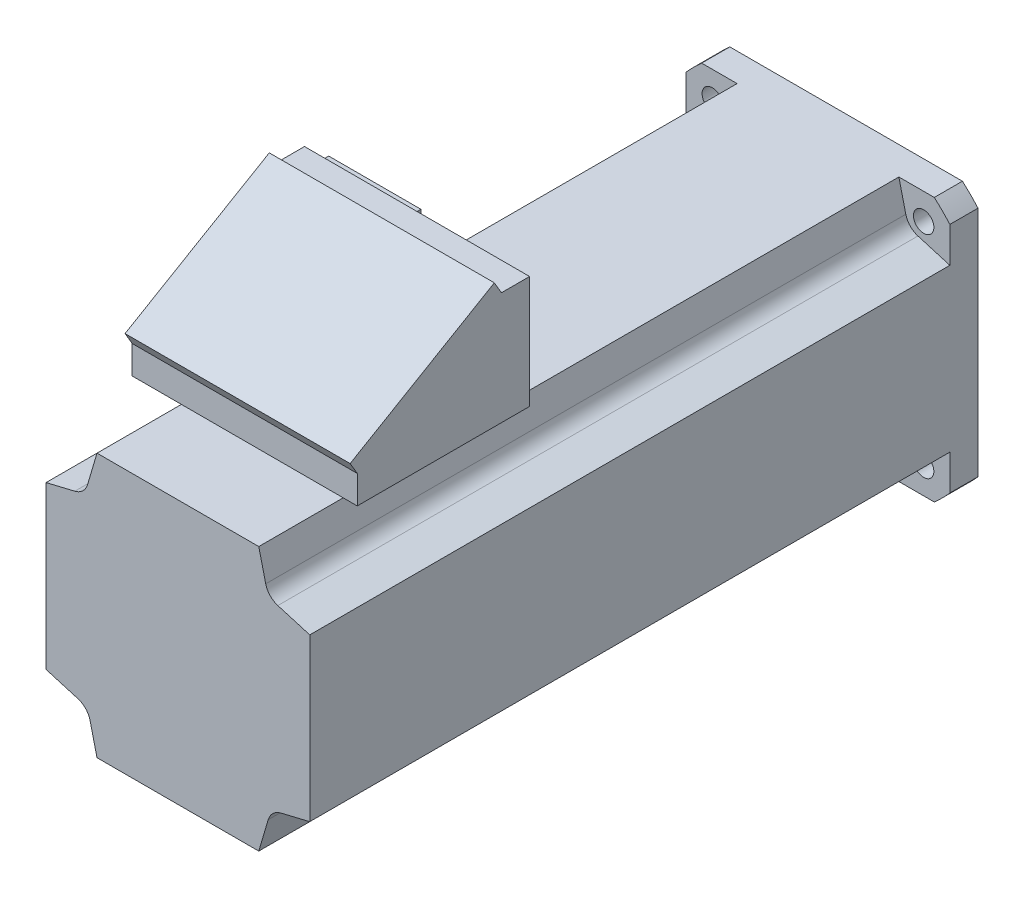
ISO-10303-21;
HEADER;
FILE_DESCRIPTION(('STEP AP214'),'2;1');
FILE_NAME('part.step','',(''),(''),'','','');
FILE_SCHEMA(('AUTOMOTIVE_DESIGN { 1 0 10303 214 1 1 1 1 }'));
ENDSEC;
DATA;
#1=APPLICATION_CONTEXT('core data for automotive mechanical design processes');
#2=APPLICATION_PROTOCOL_DEFINITION('international standard','automotive_design',2000,#1);
#3=PRODUCT_CONTEXT('',#1,'mechanical');
#4=PRODUCT('Part','Part','',(#3));
#5=PRODUCT_RELATED_PRODUCT_CATEGORY('part','',(#4));
#6=PRODUCT_DEFINITION_FORMATION('','',#4);
#7=PRODUCT_DEFINITION_CONTEXT('part definition',#1,'design');
#8=PRODUCT_DEFINITION('design','',#6,#7);
#9=PRODUCT_DEFINITION_SHAPE('','',#8);
#10=(LENGTH_UNIT() NAMED_UNIT(*) SI_UNIT(.MILLI.,.METRE.));
#11=(NAMED_UNIT(*) PLANE_ANGLE_UNIT() SI_UNIT($,.RADIAN.));
#12=(NAMED_UNIT(*) SI_UNIT($,.STERADIAN.) SOLID_ANGLE_UNIT());
#13=UNCERTAINTY_MEASURE_WITH_UNIT(LENGTH_MEASURE(1.E-05),#10,'distance_accuracy_value','');
#14=(GEOMETRIC_REPRESENTATION_CONTEXT(3) GLOBAL_UNCERTAINTY_ASSIGNED_CONTEXT((#13)) GLOBAL_UNIT_ASSIGNED_CONTEXT((#10,
#11,#12)) REPRESENTATION_CONTEXT('',''));
#15=CARTESIAN_POINT('',(0.,0.,0.));
#16=DIRECTION('',(0.,0.,1.));
#17=DIRECTION('',(1.,0.,0.));
#18=AXIS2_PLACEMENT_3D('',#15,#16,#17);
#19=CARTESIAN_POINT('',(32.,74.5,122.));
#20=DIRECTION('',(0.,0.,1.));
#21=DIRECTION('',(1.,0.,0.));
#22=AXIS2_PLACEMENT_3D('',#19,#20,#21);
#23=PLANE('',#22);
#24=DIRECTION('',(0.,-1.,0.));
#25=VECTOR('',#24,1.);
#26=CARTESIAN_POINT('',(26.4,70.4,122.));
#27=LINE('',#26,#25);
#28=CARTESIAN_POINT('',(26.4,70.4,122.));
#29=VERTEX_POINT('',#28);
#30=CARTESIAN_POINT('',(26.4,46.6,122.));
#31=VERTEX_POINT('',#30);
#32=EDGE_CURVE('E391',#29,#31,#27,.T.);
#33=ORIENTED_EDGE('',*,*,#32,.F.);
#34=DIRECTION('',(1.,0.,0.));
#35=VECTOR('',#34,1.);
#36=CARTESIAN_POINT('',(26.4,70.4,122.));
#37=LINE('',#36,#35);
#38=CARTESIAN_POINT('',(2.6,70.4,122.));
#39=VERTEX_POINT('',#38);
#40=EDGE_CURVE('E400',#39,#29,#37,.T.);
#41=ORIENTED_EDGE('',*,*,#40,.F.);
#42=DIRECTION('',(0.,1.,0.));
#43=VECTOR('',#42,1.);
#44=CARTESIAN_POINT('',(2.6,70.4,122.));
#45=LINE('',#44,#43);
#46=CARTESIAN_POINT('',(2.6,46.6,122.));
#47=VERTEX_POINT('',#46);
#48=EDGE_CURVE('E397',#47,#39,#45,.T.);
#49=ORIENTED_EDGE('',*,*,#48,.F.);
#50=DIRECTION('',(-1.,0.,0.));
#51=VECTOR('',#50,1.);
#52=CARTESIAN_POINT('',(26.4,46.6,122.));
#53=LINE('',#52,#51);
#54=EDGE_CURVE('E394',#31,#47,#53,.T.);
#55=ORIENTED_EDGE('',*,*,#54,.F.);
#56=EDGE_LOOP('',(#33,#41,#49,#55));
#57=FACE_BOUND('',#56,.T.);
#58=DIRECTION('',(0.,-1.,0.));
#59=VECTOR('',#58,1.);
#60=CARTESIAN_POINT('',(32.,74.5,122.));
#61=LINE('',#60,#59);
#62=CARTESIAN_POINT('',(32.,74.5,122.));
#63=VERTEX_POINT('',#62);
#64=CARTESIAN_POINT('',(32.,42.5,122.));
#65=VERTEX_POINT('',#64);
#66=EDGE_CURVE('E439',#63,#65,#61,.T.);
#67=ORIENTED_EDGE('',*,*,#66,.T.);
#68=DIRECTION('',(1.,0.,0.));
#69=VECTOR('',#68,1.);
#70=CARTESIAN_POINT('',(-37.5,42.5,122.));
#71=LINE('',#70,#69);
#72=CARTESIAN_POINT('',(-32.,42.5,122.));
#73=VERTEX_POINT('',#72);
#74=EDGE_CURVE('E315',#73,#65,#71,.T.);
#75=ORIENTED_EDGE('',*,*,#74,.F.);
#76=DIRECTION('',(0.,-1.,0.));
#77=VECTOR('',#76,1.);
#78=CARTESIAN_POINT('',(-32.,74.5,122.));
#79=LINE('',#78,#77);
#80=CARTESIAN_POINT('',(-32.,74.5,122.));
#81=VERTEX_POINT('',#80);
#82=EDGE_CURVE('E436',#81,#73,#79,.T.);
#83=ORIENTED_EDGE('',*,*,#82,.F.);
#84=DIRECTION('',(-1.,0.,0.));
#85=VECTOR('',#84,1.);
#86=CARTESIAN_POINT('',(32.,74.5,122.));
#87=LINE('',#86,#85);
#88=EDGE_CURVE('E426',#63,#81,#87,.T.);
#89=ORIENTED_EDGE('',*,*,#88,.F.);
#90=EDGE_LOOP('',(#67,#75,#83,#89));
#91=FACE_BOUND('',#90,.T.);
#92=DIRECTION('',(0.,-1.,0.));
#93=VECTOR('',#92,1.);
#94=CARTESIAN_POINT('',(-2.9,71.6,122.));
#95=LINE('',#94,#93);
#96=CARTESIAN_POINT('',(-2.9,71.6,122.));
#97=VERTEX_POINT('',#96);
#98=CARTESIAN_POINT('',(-2.9,45.4,122.));
#99=VERTEX_POINT('',#98);
#100=EDGE_CURVE('E358',#97,#99,#95,.T.);
#101=ORIENTED_EDGE('',*,*,#100,.F.);
#102=DIRECTION('',(1.,0.,0.));
#103=VECTOR('',#102,1.);
#104=CARTESIAN_POINT('',(-2.9,71.6,122.));
#105=LINE('',#104,#103);
#106=CARTESIAN_POINT('',(-29.1,71.6,122.));
#107=VERTEX_POINT('',#106);
#108=EDGE_CURVE('E367',#107,#97,#105,.T.);
#109=ORIENTED_EDGE('',*,*,#108,.F.);
#110=DIRECTION('',(0.,1.,0.));
#111=VECTOR('',#110,1.);
#112=CARTESIAN_POINT('',(-29.1,71.6,122.));
#113=LINE('',#112,#111);
#114=CARTESIAN_POINT('',(-29.1,45.4,122.));
#115=VERTEX_POINT('',#114);
#116=EDGE_CURVE('E364',#115,#107,#113,.T.);
#117=ORIENTED_EDGE('',*,*,#116,.F.);
#118=DIRECTION('',(-1.,0.,0.));
#119=VECTOR('',#118,1.);
#120=CARTESIAN_POINT('',(-2.9,45.4,122.));
#121=LINE('',#120,#119);
#122=EDGE_CURVE('E361',#99,#115,#121,.T.);
#123=ORIENTED_EDGE('',*,*,#122,.F.);
#124=EDGE_LOOP('',(#101,#109,#117,#123));
#125=FACE_BOUND('',#124,.T.);
#126=ADVANCED_FACE('F16',(#57,#91,#125),#23,.F.);
#127=CARTESIAN_POINT('',(-33.0718913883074,37.5,190.));
#128=DIRECTION('',(0.,-1.,0.));
#129=DIRECTION('',(0.,0.,-1.));
#130=AXIS2_PLACEMENT_3D('',#127,#128,#129);
#131=PLANE('',#130);
#132=DIRECTION('',(0.,0.,-1.));
#133=VECTOR('',#132,1.);
#134=CARTESIAN_POINT('',(16.,37.5,190.));
#135=LINE('',#134,#133);
#136=CARTESIAN_POINT('',(16.,37.5,161.));
#137=VERTEX_POINT('',#136);
#138=CARTESIAN_POINT('',(16.,37.5,132.));
#139=VERTEX_POINT('',#138);
#140=EDGE_CURVE('E31',#137,#139,#135,.T.);
#141=ORIENTED_EDGE('',*,*,#140,.F.);
#142=DIRECTION('',(1.,0.,0.));
#143=VECTOR('',#142,1.);
#144=CARTESIAN_POINT('',(-37.5,37.5,161.));
#145=LINE('',#144,#143);
#146=CARTESIAN_POINT('',(-16.,37.5,161.));
#147=VERTEX_POINT('',#146);
#148=EDGE_CURVE('E640',#147,#137,#145,.T.);
#149=ORIENTED_EDGE('',*,*,#148,.F.);
#150=DIRECTION('',(0.,0.,-1.));
#151=VECTOR('',#150,1.);
#152=CARTESIAN_POINT('',(-16.,37.5,190.));
#153=LINE('',#152,#151);
#154=CARTESIAN_POINT('',(-16.,37.5,132.));
#155=VERTEX_POINT('',#154);
#156=EDGE_CURVE('E308',#147,#155,#153,.T.);
#157=ORIENTED_EDGE('',*,*,#156,.T.);
#158=DIRECTION('',(1.,0.,0.));
#159=VECTOR('',#158,1.);
#160=CARTESIAN_POINT('',(-37.5,37.5,132.));
#161=LINE('',#160,#159);
#162=EDGE_CURVE('E303',#155,#139,#161,.T.);
#163=ORIENTED_EDGE('',*,*,#162,.T.);
#164=EDGE_LOOP('',(#141,#149,#157,#163));
#165=FACE_BOUND('',#164,.T.);
#166=DIRECTION('',(0.,0.,-1.));
#167=VECTOR('',#166,1.);
#168=CARTESIAN_POINT('',(-23.,37.5,190.));
#169=LINE('',#168,#167);
#170=CARTESIAN_POINT('',(-23.,37.5,190.));
#171=VERTEX_POINT('',#170);
#172=CARTESIAN_POINT('',(-23.,37.5,8.));
#173=VERTEX_POINT('',#172);
#174=EDGE_CURVE('E529',#171,#173,#169,.T.);
#175=ORIENTED_EDGE('',*,*,#174,.F.);
#176=DIRECTION('',(-1.,0.,0.));
#177=VECTOR('',#176,1.);
#178=CARTESIAN_POINT('',(-33.0718913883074,37.5,190.));
#179=LINE('',#178,#177);
#180=CARTESIAN_POINT('',(23.,37.5,190.));
#181=VERTEX_POINT('',#180);
#182=EDGE_CURVE('E558',#181,#171,#179,.T.);
#183=ORIENTED_EDGE('',*,*,#182,.F.);
#184=DIRECTION('',(0.,0.,-1.));
#185=VECTOR('',#184,1.);
#186=CARTESIAN_POINT('',(23.,37.5,190.));
#187=LINE('',#186,#185);
#188=CARTESIAN_POINT('',(23.,37.5,8.));
#189=VERTEX_POINT('',#188);
#190=EDGE_CURVE('E503',#181,#189,#187,.T.);
#191=ORIENTED_EDGE('',*,*,#190,.T.);
#192=DIRECTION('',(-1.,0.,0.));
#193=VECTOR('',#192,1.);
#194=CARTESIAN_POINT('',(33.0718913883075,37.5,8.));
#195=LINE('',#194,#193);
#196=CARTESIAN_POINT('',(33.0718913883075,37.5,8.));
#197=VERTEX_POINT('',#196);
#198=EDGE_CURVE('E495',#197,#189,#195,.T.);
#199=ORIENTED_EDGE('',*,*,#198,.F.);
#200=DIRECTION('',(0.,0.,-1.));
#201=VECTOR('',#200,1.);
#202=CARTESIAN_POINT('',(33.0718913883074,37.5,190.));
#203=LINE('',#202,#201);
#204=CARTESIAN_POINT('',(33.0718913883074,37.5,0.));
#205=VERTEX_POINT('',#204);
#206=EDGE_CURVE('E583',#197,#205,#203,.T.);
#207=ORIENTED_EDGE('',*,*,#206,.T.);
#208=DIRECTION('',(-1.,0.,0.));
#209=VECTOR('',#208,1.);
#210=CARTESIAN_POINT('',(-33.0718913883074,37.5,0.));
#211=LINE('',#210,#209);
#212=CARTESIAN_POINT('',(-33.0718913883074,37.5,0.));
#213=VERTEX_POINT('',#212);
#214=EDGE_CURVE('E537',#205,#213,#211,.T.);
#215=ORIENTED_EDGE('',*,*,#214,.T.);
#216=DIRECTION('',(0.,0.,-1.));
#217=VECTOR('',#216,1.);
#218=CARTESIAN_POINT('',(-33.0718913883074,37.5,190.));
#219=LINE('',#218,#217);
#220=CARTESIAN_POINT('',(-33.0718913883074,37.5,8.));
#221=VERTEX_POINT('',#220);
#222=EDGE_CURVE('E581',#221,#213,#219,.T.);
#223=ORIENTED_EDGE('',*,*,#222,.F.);
#224=DIRECTION('',(-1.,0.,0.));
#225=VECTOR('',#224,1.);
#226=CARTESIAN_POINT('',(-23.,37.5,8.));
#227=LINE('',#226,#225);
#228=EDGE_CURVE('E514',#173,#221,#227,.T.);
#229=ORIENTED_EDGE('',*,*,#228,.F.);
#230=EDGE_LOOP('',(#175,#183,#191,#199,#207,#215,#223,#229));
#231=FACE_BOUND('',#230,.T.);
#232=ADVANCED_FACE('F306',(#165,#231),#131,.F.);
#233=CARTESIAN_POINT('',(0.,0.,190.));
#234=DIRECTION('',(0.,0.,1.));
#235=DIRECTION('',(1.,0.,0.));
#236=AXIS2_PLACEMENT_3D('',#233,#234,#235);
#237=PLANE('',#236);
#238=DIRECTION('',(-0.959042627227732,0.283261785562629,0.));
#239=VECTOR('',#238,1.);
#240=CARTESIAN_POINT('',(-25.6500104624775,-26.5,190.));
#241=LINE('',#240,#239);
#242=CARTESIAN_POINT('',(-28.4185280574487,-25.6822936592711,190.));
#243=VERTEX_POINT('',#242);
#244=CARTESIAN_POINT('',(-37.5,-22.9999999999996,190.));
#245=VERTEX_POINT('',#244);
#246=EDGE_CURVE('E456',#243,#245,#241,.T.);
#247=ORIENTED_EDGE('',*,*,#246,.F.);
#248=CARTESIAN_POINT('',(-29.8348369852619,-30.4775067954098,190.));
#249=DIRECTION('',(0.,0.,1.));
#250=DIRECTION('',(1.,0.,0.));
#251=AXIS2_PLACEMENT_3D('',#248,#249,#250);
#252=CIRCLE('',#251,5.);
#253=CARTESIAN_POINT('',(-24.9739061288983,-29.3064597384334,190.));
#254=VERTEX_POINT('',#253);
#255=EDGE_CURVE('E626',#243,#254,#252,.F.);
#256=ORIENTED_EDGE('',*,*,#255,.T.);
#257=DIRECTION('',(-0.234209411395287,0.972186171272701,0.));
#258=VECTOR('',#257,1.);
#259=CARTESIAN_POINT('',(-23.0000000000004,-37.5,190.));
#260=LINE('',#259,#258);
#261=CARTESIAN_POINT('',(-23.0000000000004,-37.5,190.));
#262=VERTEX_POINT('',#261);
#263=EDGE_CURVE('E453',#262,#254,#260,.T.);
#264=ORIENTED_EDGE('',*,*,#263,.F.);
#265=DIRECTION('',(1.,0.,0.));
#266=VECTOR('',#265,1.);
#267=CARTESIAN_POINT('',(-33.0718913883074,-37.5,190.));
#268=LINE('',#267,#266);
#269=CARTESIAN_POINT('',(22.9999999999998,-37.5,190.));
#270=VERTEX_POINT('',#269);
#271=EDGE_CURVE('E563',#262,#270,#268,.T.);
#272=ORIENTED_EDGE('',*,*,#271,.T.);
#273=DIRECTION('',(-0.283261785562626,-0.959042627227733,0.));
#274=VECTOR('',#273,1.);
#275=CARTESIAN_POINT('',(26.5,-25.6500104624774,190.));
#276=LINE('',#275,#274);
#277=CARTESIAN_POINT('',(25.6822936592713,-28.4185280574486,190.));
#278=VERTEX_POINT('',#277);
#279=EDGE_CURVE('E478',#278,#270,#276,.T.);
#280=ORIENTED_EDGE('',*,*,#279,.F.);
#281=CARTESIAN_POINT('',(30.4775067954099,-29.8348369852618,190.));
#282=DIRECTION('',(0.,0.,1.));
#283=DIRECTION('',(1.,0.,0.));
#284=AXIS2_PLACEMENT_3D('',#281,#282,#283);
#285=CIRCLE('',#284,5.);
#286=CARTESIAN_POINT('',(29.3064597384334,-24.9739061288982,190.));
#287=VERTEX_POINT('',#286);
#288=EDGE_CURVE('E628',#278,#287,#285,.F.);
#289=ORIENTED_EDGE('',*,*,#288,.T.);
#290=DIRECTION('',(-0.9721861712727,-0.234209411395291,0.));
#291=VECTOR('',#290,1.);
#292=CARTESIAN_POINT('',(37.5,-23.0000000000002,190.));
#293=LINE('',#292,#291);
#294=CARTESIAN_POINT('',(37.5,-23.0000000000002,190.));
#295=VERTEX_POINT('',#294);
#296=EDGE_CURVE('E475',#295,#287,#293,.T.);
#297=ORIENTED_EDGE('',*,*,#296,.F.);
#298=DIRECTION('',(0.,1.,0.));
#299=VECTOR('',#298,1.);
#300=CARTESIAN_POINT('',(37.5,33.0718913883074,190.));
#301=LINE('',#300,#299);
#302=CARTESIAN_POINT('',(37.5,23.,190.));
#303=VERTEX_POINT('',#302);
#304=EDGE_CURVE('E566',#295,#303,#301,.T.);
#305=ORIENTED_EDGE('',*,*,#304,.T.);
#306=DIRECTION('',(0.959042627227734,-0.283261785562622,0.));
#307=VECTOR('',#306,1.);
#308=CARTESIAN_POINT('',(25.6500104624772,26.5,190.));
#309=LINE('',#308,#307);
#310=CARTESIAN_POINT('',(28.4185280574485,25.6822936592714,190.));
#311=VERTEX_POINT('',#310);
#312=EDGE_CURVE('E501',#311,#303,#309,.T.);
#313=ORIENTED_EDGE('',*,*,#312,.F.);
#314=CARTESIAN_POINT('',(29.8348369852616,30.47750679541,190.));
#315=DIRECTION('',(0.,0.,1.));
#316=DIRECTION('',(1.,0.,0.));
#317=AXIS2_PLACEMENT_3D('',#314,#315,#316);
#318=CIRCLE('',#317,5.);
#319=CARTESIAN_POINT('',(24.9739061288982,29.3064597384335,190.));
#320=VERTEX_POINT('',#319);
#321=EDGE_CURVE('E630',#311,#320,#318,.F.);
#322=ORIENTED_EDGE('',*,*,#321,.T.);
#323=DIRECTION('',(0.234209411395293,-0.972186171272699,0.));
#324=VECTOR('',#323,1.);
#325=CARTESIAN_POINT('',(23.,37.5,190.));
#326=LINE('',#325,#324);
#327=EDGE_CURVE('E498',#181,#320,#326,.T.);
#328=ORIENTED_EDGE('',*,*,#327,.F.);
#329=ORIENTED_EDGE('',*,*,#182,.T.);
#330=DIRECTION('',(0.283261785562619,0.959042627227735,0.));
#331=VECTOR('',#330,1.);
#332=CARTESIAN_POINT('',(-26.5,25.6500104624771,190.));
#333=LINE('',#332,#331);
#334=CARTESIAN_POINT('',(-25.6822936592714,28.4185280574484,190.));
#335=VERTEX_POINT('',#334);
#336=EDGE_CURVE('E523',#335,#171,#333,.T.);
#337=ORIENTED_EDGE('',*,*,#336,.F.);
#338=CARTESIAN_POINT('',(-30.4775067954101,29.8348369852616,190.));
#339=DIRECTION('',(0.,0.,1.));
#340=DIRECTION('',(1.,0.,0.));
#341=AXIS2_PLACEMENT_3D('',#338,#339,#340);
#342=CIRCLE('',#341,5.);
#343=CARTESIAN_POINT('',(-29.3064597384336,24.9739061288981,190.));
#344=VERTEX_POINT('',#343);
#345=EDGE_CURVE('E624',#335,#344,#342,.F.);
#346=ORIENTED_EDGE('',*,*,#345,.T.);
#347=DIRECTION('',(0.972186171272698,0.234209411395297,0.));
#348=VECTOR('',#347,1.);
#349=CARTESIAN_POINT('',(-37.5,23.,190.));
#350=LINE('',#349,#348);
#351=CARTESIAN_POINT('',(-37.5,23.,190.));
#352=VERTEX_POINT('',#351);
#353=EDGE_CURVE('E520',#352,#344,#350,.T.);
#354=ORIENTED_EDGE('',*,*,#353,.F.);
#355=DIRECTION('',(0.,-1.,0.));
#356=VECTOR('',#355,1.);
#357=CARTESIAN_POINT('',(-37.5,33.0718913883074,190.));
#358=LINE('',#357,#356);
#359=EDGE_CURVE('E560',#352,#245,#358,.T.);
#360=ORIENTED_EDGE('',*,*,#359,.T.);
#361=EDGE_LOOP('',(#247,#256,#264,#272,#280,#289,#297,#305,#313,#322,#328,#329,#337,#346,#354,#360));
#362=FACE_BOUND('',#361,.T.);
#363=ADVANCED_FACE('F672',(#362),#237,.T.);
#364=CARTESIAN_POINT('',(-33.0718913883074,-37.5,190.));
#365=DIRECTION('',(0.,1.,0.));
#366=DIRECTION('',(0.,0.,1.));
#367=AXIS2_PLACEMENT_3D('',#364,#365,#366);
#368=PLANE('',#367);
#369=DIRECTION('',(0.,0.,-1.));
#370=VECTOR('',#369,1.);
#371=CARTESIAN_POINT('',(-23.0000000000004,-37.5,190.));
#372=LINE('',#371,#370);
#373=CARTESIAN_POINT('',(-23.0000000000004,-37.5,8.));
#374=VERTEX_POINT('',#373);
#375=EDGE_CURVE('E458',#262,#374,#372,.T.);
#376=ORIENTED_EDGE('',*,*,#375,.T.);
#377=DIRECTION('',(1.,0.,0.));
#378=VECTOR('',#377,1.);
#379=CARTESIAN_POINT('',(-33.0718913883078,-37.5,8.));
#380=LINE('',#379,#378);
#381=CARTESIAN_POINT('',(-33.0718913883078,-37.5,8.));
#382=VERTEX_POINT('',#381);
#383=EDGE_CURVE('E451',#382,#374,#380,.T.);
#384=ORIENTED_EDGE('',*,*,#383,.F.);
#385=DIRECTION('',(0.,0.,-1.));
#386=VECTOR('',#385,1.);
#387=CARTESIAN_POINT('',(-33.0718913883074,-37.5,190.));
#388=LINE('',#387,#386);
#389=CARTESIAN_POINT('',(-33.0718913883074,-37.5,0.));
#390=VERTEX_POINT('',#389);
#391=EDGE_CURVE('E575',#382,#390,#388,.T.);
#392=ORIENTED_EDGE('',*,*,#391,.T.);
#393=DIRECTION('',(1.,0.,0.));
#394=VECTOR('',#393,1.);
#395=CARTESIAN_POINT('',(-33.0718913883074,-37.5,0.));
#396=LINE('',#395,#394);
#397=CARTESIAN_POINT('',(33.0718913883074,-37.5,0.));
#398=VERTEX_POINT('',#397);
#399=EDGE_CURVE('E549',#390,#398,#396,.T.);
#400=ORIENTED_EDGE('',*,*,#399,.T.);
#401=DIRECTION('',(0.,0.,-1.));
#402=VECTOR('',#401,1.);
#403=CARTESIAN_POINT('',(33.0718913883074,-37.5,190.));
#404=LINE('',#403,#402);
#405=CARTESIAN_POINT('',(33.0718913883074,-37.5,8.));
#406=VERTEX_POINT('',#405);
#407=EDGE_CURVE('E573',#406,#398,#404,.T.);
#408=ORIENTED_EDGE('',*,*,#407,.F.);
#409=DIRECTION('',(1.,0.,0.));
#410=VECTOR('',#409,1.);
#411=CARTESIAN_POINT('',(22.9999999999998,-37.5,8.));
#412=LINE('',#411,#410);
#413=CARTESIAN_POINT('',(22.9999999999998,-37.5,8.));
#414=VERTEX_POINT('',#413);
#415=EDGE_CURVE('E469',#414,#406,#412,.T.);
#416=ORIENTED_EDGE('',*,*,#415,.F.);
#417=DIRECTION('',(0.,0.,-1.));
#418=VECTOR('',#417,1.);
#419=CARTESIAN_POINT('',(22.9999999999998,-37.5,190.));
#420=LINE('',#419,#418);
#421=EDGE_CURVE('E483',#270,#414,#420,.T.);
#422=ORIENTED_EDGE('',*,*,#421,.F.);
#423=ORIENTED_EDGE('',*,*,#271,.F.);
#424=EDGE_LOOP('',(#376,#384,#392,#400,#408,#416,#422,#423));
#425=FACE_BOUND('',#424,.T.);
#426=ADVANCED_FACE('F745',(#425),#368,.F.);
#427=CARTESIAN_POINT('',(-37.5,33.0718913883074,190.));
#428=DIRECTION('',(1.,0.,0.));
#429=DIRECTION('',(0.,0.,-1.));
#430=AXIS2_PLACEMENT_3D('',#427,#428,#429);
#431=PLANE('',#430);
#432=DIRECTION('',(0.,0.,-1.));
#433=VECTOR('',#432,1.);
#434=CARTESIAN_POINT('',(-37.5,-22.9999999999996,190.));
#435=LINE('',#434,#433);
#436=CARTESIAN_POINT('',(-37.5,-22.9999999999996,8.));
#437=VERTEX_POINT('',#436);
#438=EDGE_CURVE('E461',#245,#437,#435,.T.);
#439=ORIENTED_EDGE('',*,*,#438,.F.);
#440=ORIENTED_EDGE('',*,*,#359,.F.);
#441=DIRECTION('',(0.,0.,-1.));
#442=VECTOR('',#441,1.);
#443=CARTESIAN_POINT('',(-37.5,23.,190.));
#444=LINE('',#443,#442);
#445=CARTESIAN_POINT('',(-37.5,23.,8.));
#446=VERTEX_POINT('',#445);
#447=EDGE_CURVE('E526',#352,#446,#444,.T.);
#448=ORIENTED_EDGE('',*,*,#447,.T.);
#449=DIRECTION('',(0.,-1.,0.));
#450=VECTOR('',#449,1.);
#451=CARTESIAN_POINT('',(-37.5,33.0718913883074,8.));
#452=LINE('',#451,#450);
#453=CARTESIAN_POINT('',(-37.5,33.0718913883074,8.));
#454=VERTEX_POINT('',#453);
#455=EDGE_CURVE('E518',#454,#446,#452,.T.);
#456=ORIENTED_EDGE('',*,*,#455,.F.);
#457=DIRECTION('',(0.,0.,-1.));
#458=VECTOR('',#457,1.);
#459=CARTESIAN_POINT('',(-37.5,33.0718913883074,190.));
#460=LINE('',#459,#458);
#461=CARTESIAN_POINT('',(-37.5,33.0718913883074,0.));
#462=VERTEX_POINT('',#461);
#463=EDGE_CURVE('E579',#454,#462,#460,.T.);
#464=ORIENTED_EDGE('',*,*,#463,.T.);
#465=DIRECTION('',(0.,-1.,0.));
#466=VECTOR('',#465,1.);
#467=CARTESIAN_POINT('',(-37.5,33.0718913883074,0.));
#468=LINE('',#467,#466);
#469=CARTESIAN_POINT('',(-37.5,-33.0718913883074,0.));
#470=VERTEX_POINT('',#469);
#471=EDGE_CURVE('E543',#462,#470,#468,.T.);
#472=ORIENTED_EDGE('',*,*,#471,.T.);
#473=DIRECTION('',(0.,0.,-1.));
#474=VECTOR('',#473,1.);
#475=CARTESIAN_POINT('',(-37.5,-33.0718913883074,190.));
#476=LINE('',#475,#474);
#477=CARTESIAN_POINT('',(-37.5,-33.0718913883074,8.));
#478=VERTEX_POINT('',#477);
#479=EDGE_CURVE('E577',#478,#470,#476,.T.);
#480=ORIENTED_EDGE('',*,*,#479,.F.);
#481=DIRECTION('',(0.,-1.,0.));
#482=VECTOR('',#481,1.);
#483=CARTESIAN_POINT('',(-37.5,-22.9999999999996,8.));
#484=LINE('',#483,#482);
#485=EDGE_CURVE('E447',#437,#478,#484,.T.);
#486=ORIENTED_EDGE('',*,*,#485,.F.);
#487=EDGE_LOOP('',(#439,#440,#448,#456,#464,#472,#480,#486));
#488=FACE_BOUND('',#487,.T.);
#489=ADVANCED_FACE('F758',(#488),#431,.F.);
#490=CARTESIAN_POINT('',(0.,0.,190.));
#491=DIRECTION('',(0.,0.,-1.));
#492=DIRECTION('',(-1.,0.,0.));
#493=AXIS2_PLACEMENT_3D('',#490,#491,#492);
#494=CYLINDRICAL_SURFACE('',#493,50.);
#495=CARTESIAN_POINT('',(0.,0.,8.));
#496=DIRECTION('',(0.,0.,1.));
#497=DIRECTION('',(0.,1.,0.));
#498=AXIS2_PLACEMENT_3D('',#495,#496,#497);
#499=CIRCLE('',#498,50.);
#500=EDGE_CURVE('E449',#478,#382,#499,.T.);
#501=ORIENTED_EDGE('',*,*,#500,.F.);
#502=ORIENTED_EDGE('',*,*,#479,.T.);
#503=CARTESIAN_POINT('',(0.,0.,0.));
#504=DIRECTION('',(0.,0.,1.));
#505=DIRECTION('',(1.,0.,0.));
#506=AXIS2_PLACEMENT_3D('',#503,#504,#505);
#507=CIRCLE('',#506,50.);
#508=EDGE_CURVE('E546',#470,#390,#507,.T.);
#509=ORIENTED_EDGE('',*,*,#508,.T.);
#510=ORIENTED_EDGE('',*,*,#391,.F.);
#511=EDGE_LOOP('',(#501,#502,#509,#510));
#512=FACE_BOUND('',#511,.T.);
#513=ADVANCED_FACE('F751',(#512),#494,.T.);
#514=CARTESIAN_POINT('',(37.5,33.0718913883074,190.));
#515=DIRECTION('',(-1.,0.,0.));
#516=DIRECTION('',(0.,0.,1.));
#517=AXIS2_PLACEMENT_3D('',#514,#515,#516);
#518=PLANE('',#517);
#519=DIRECTION('',(0.,0.,-1.));
#520=VECTOR('',#519,1.);
#521=CARTESIAN_POINT('',(37.5,-23.0000000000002,190.));
#522=LINE('',#521,#520);
#523=CARTESIAN_POINT('',(37.5,-23.0000000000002,8.));
#524=VERTEX_POINT('',#523);
#525=EDGE_CURVE('E480',#295,#524,#522,.T.);
#526=ORIENTED_EDGE('',*,*,#525,.T.);
#527=DIRECTION('',(0.,1.,0.));
#528=VECTOR('',#527,1.);
#529=CARTESIAN_POINT('',(37.5,-33.0718913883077,8.));
#530=LINE('',#529,#528);
#531=CARTESIAN_POINT('',(37.5,-33.0718913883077,8.));
#532=VERTEX_POINT('',#531);
#533=EDGE_CURVE('E473',#532,#524,#530,.T.);
#534=ORIENTED_EDGE('',*,*,#533,.F.);
#535=DIRECTION('',(0.,0.,-1.));
#536=VECTOR('',#535,1.);
#537=CARTESIAN_POINT('',(37.5,-33.0718913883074,190.));
#538=LINE('',#537,#536);
#539=CARTESIAN_POINT('',(37.5,-33.0718913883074,0.));
#540=VERTEX_POINT('',#539);
#541=EDGE_CURVE('E571',#532,#540,#538,.T.);
#542=ORIENTED_EDGE('',*,*,#541,.T.);
#543=DIRECTION('',(0.,1.,0.));
#544=VECTOR('',#543,1.);
#545=CARTESIAN_POINT('',(37.5,33.0718913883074,0.));
#546=LINE('',#545,#544);
#547=CARTESIAN_POINT('',(37.5,33.0718913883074,0.));
#548=VERTEX_POINT('',#547);
#549=EDGE_CURVE('E555',#540,#548,#546,.T.);
#550=ORIENTED_EDGE('',*,*,#549,.T.);
#551=DIRECTION('',(0.,0.,-1.));
#552=VECTOR('',#551,1.);
#553=CARTESIAN_POINT('',(37.5,33.0718913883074,190.));
#554=LINE('',#553,#552);
#555=CARTESIAN_POINT('',(37.5,33.0718913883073,8.));
#556=VERTEX_POINT('',#555);
#557=EDGE_CURVE('E569',#556,#548,#554,.T.);
#558=ORIENTED_EDGE('',*,*,#557,.F.);
#559=DIRECTION('',(0.,1.,0.));
#560=VECTOR('',#559,1.);
#561=CARTESIAN_POINT('',(37.5,23.,8.));
#562=LINE('',#561,#560);
#563=CARTESIAN_POINT('',(37.5,23.,8.));
#564=VERTEX_POINT('',#563);
#565=EDGE_CURVE('E491',#564,#556,#562,.T.);
#566=ORIENTED_EDGE('',*,*,#565,.F.);
#567=DIRECTION('',(0.,0.,-1.));
#568=VECTOR('',#567,1.);
#569=CARTESIAN_POINT('',(37.5,23.,190.));
#570=LINE('',#569,#568);
#571=EDGE_CURVE('E505',#303,#564,#570,.T.);
#572=ORIENTED_EDGE('',*,*,#571,.F.);
#573=ORIENTED_EDGE('',*,*,#304,.F.);
#574=EDGE_LOOP('',(#526,#534,#542,#550,#558,#566,#572,#573));
#575=FACE_BOUND('',#574,.T.);
#576=ADVANCED_FACE('F747',(#575),#518,.F.);
#577=CARTESIAN_POINT('',(0.,0.,190.));
#578=DIRECTION('',(0.,0.,-1.));
#579=DIRECTION('',(-1.,0.,0.));
#580=AXIS2_PLACEMENT_3D('',#577,#578,#579);
#581=CYLINDRICAL_SURFACE('',#580,50.);
#582=CARTESIAN_POINT('',(0.,0.,8.));
#583=DIRECTION('',(0.,0.,1.));
#584=DIRECTION('',(-1.,0.,0.));
#585=AXIS2_PLACEMENT_3D('',#582,#583,#584);
#586=CIRCLE('',#585,50.);
#587=EDGE_CURVE('E471',#406,#532,#586,.T.);
#588=ORIENTED_EDGE('',*,*,#587,.F.);
#589=ORIENTED_EDGE('',*,*,#407,.T.);
#590=CARTESIAN_POINT('',(0.,0.,0.));
#591=DIRECTION('',(0.,0.,1.));
#592=DIRECTION('',(1.,0.,0.));
#593=AXIS2_PLACEMENT_3D('',#590,#591,#592);
#594=CIRCLE('',#593,50.);
#595=EDGE_CURVE('E552',#398,#540,#594,.T.);
#596=ORIENTED_EDGE('',*,*,#595,.T.);
#597=ORIENTED_EDGE('',*,*,#541,.F.);
#598=EDGE_LOOP('',(#588,#589,#596,#597));
#599=FACE_BOUND('',#598,.T.);
#600=ADVANCED_FACE('F750',(#599),#581,.T.);
#601=CARTESIAN_POINT('',(0.,0.,190.));
#602=DIRECTION('',(0.,0.,-1.));
#603=DIRECTION('',(-1.,0.,0.));
#604=AXIS2_PLACEMENT_3D('',#601,#602,#603);
#605=CYLINDRICAL_SURFACE('',#604,50.);
#606=CARTESIAN_POINT('',(0.,0.,8.));
#607=DIRECTION('',(0.,0.,1.));
#608=DIRECTION('',(0.,-1.,0.));
#609=AXIS2_PLACEMENT_3D('',#606,#607,#608);
#610=CIRCLE('',#609,50.);
#611=EDGE_CURVE('E493',#556,#197,#610,.T.);
#612=ORIENTED_EDGE('',*,*,#611,.F.);
#613=ORIENTED_EDGE('',*,*,#557,.T.);
#614=CARTESIAN_POINT('',(0.,0.,0.));
#615=DIRECTION('',(0.,0.,1.));
#616=DIRECTION('',(1.,0.,0.));
#617=AXIS2_PLACEMENT_3D('',#614,#615,#616);
#618=CIRCLE('',#617,50.);
#619=EDGE_CURVE('E534',#548,#205,#618,.T.);
#620=ORIENTED_EDGE('',*,*,#619,.T.);
#621=ORIENTED_EDGE('',*,*,#206,.F.);
#622=EDGE_LOOP('',(#612,#613,#620,#621));
#623=FACE_BOUND('',#622,.T.);
#624=ADVANCED_FACE('F18',(#623),#605,.T.);
#625=CARTESIAN_POINT('',(0.,0.,190.));
#626=DIRECTION('',(0.,0.,-1.));
#627=DIRECTION('',(-1.,0.,0.));
#628=AXIS2_PLACEMENT_3D('',#625,#626,#627);
#629=CYLINDRICAL_SURFACE('',#628,50.);
#630=CARTESIAN_POINT('',(0.,0.,8.));
#631=DIRECTION('',(0.,0.,1.));
#632=DIRECTION('',(1.,0.,0.));
#633=AXIS2_PLACEMENT_3D('',#630,#631,#632);
#634=CIRCLE('',#633,50.);
#635=EDGE_CURVE('E516',#221,#454,#634,.T.);
#636=ORIENTED_EDGE('',*,*,#635,.F.);
#637=ORIENTED_EDGE('',*,*,#222,.T.);
#638=CARTESIAN_POINT('',(0.,0.,0.));
#639=DIRECTION('',(0.,0.,1.));
#640=DIRECTION('',(1.,0.,0.));
#641=AXIS2_PLACEMENT_3D('',#638,#639,#640);
#642=CIRCLE('',#641,50.);
#643=EDGE_CURVE('E540',#213,#462,#642,.T.);
#644=ORIENTED_EDGE('',*,*,#643,.T.);
#645=ORIENTED_EDGE('',*,*,#463,.F.);
#646=EDGE_LOOP('',(#636,#637,#644,#645));
#647=FACE_BOUND('',#646,.T.);
#648=ADVANCED_FACE('F741',(#647),#629,.T.);
#649=CARTESIAN_POINT('',(0.,0.,0.));
#650=DIRECTION('',(0.,0.,1.));
#651=DIRECTION('',(1.,0.,0.));
#652=AXIS2_PLACEMENT_3D('',#649,#650,#651);
#653=PLANE('',#652);
#654=CARTESIAN_POINT('',(-30.0520382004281,30.0520382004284,0.));
#655=DIRECTION('',(0.,0.,-1.));
#656=DIRECTION('',(-1.,0.,0.));
#657=AXIS2_PLACEMENT_3D('',#654,#655,#656);
#658=CIRCLE('',#657,2.9);
#659=CARTESIAN_POINT('',(-32.9520382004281,30.0520382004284,0.));
#660=VERTEX_POINT('',#659);
#661=EDGE_CURVE('E342',#660,#660,#658,.T.);
#662=ORIENTED_EDGE('',*,*,#661,.F.);
#663=EDGE_LOOP('',(#662));
#664=FACE_BOUND('',#663,.T.);
#665=CARTESIAN_POINT('',(-30.0520382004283,-30.0520382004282,0.));
#666=DIRECTION('',(0.,0.,-1.));
#667=DIRECTION('',(-1.,0.,0.));
#668=AXIS2_PLACEMENT_3D('',#665,#666,#667);
#669=CIRCLE('',#668,2.9);
#670=CARTESIAN_POINT('',(-32.9520382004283,-30.0520382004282,0.));
#671=VERTEX_POINT('',#670);
#672=EDGE_CURVE('E346',#671,#671,#669,.T.);
#673=ORIENTED_EDGE('',*,*,#672,.F.);
#674=EDGE_LOOP('',(#673));
#675=FACE_BOUND('',#674,.T.);
#676=CARTESIAN_POINT('',(30.0520382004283,-30.0520382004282,0.));
#677=DIRECTION('',(0.,0.,-1.));
#678=DIRECTION('',(-1.,0.,0.));
#679=AXIS2_PLACEMENT_3D('',#676,#677,#678);
#680=CIRCLE('',#679,2.9);
#681=CARTESIAN_POINT('',(27.1520382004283,-30.0520382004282,0.));
#682=VERTEX_POINT('',#681);
#683=EDGE_CURVE('E350',#682,#682,#680,.T.);
#684=ORIENTED_EDGE('',*,*,#683,.F.);
#685=EDGE_LOOP('',(#684));
#686=FACE_BOUND('',#685,.T.);
#687=CARTESIAN_POINT('',(30.0520382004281,30.0520382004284,0.));
#688=DIRECTION('',(0.,0.,-1.));
#689=DIRECTION('',(-1.,0.,0.));
#690=AXIS2_PLACEMENT_3D('',#687,#688,#689);
#691=CIRCLE('',#690,2.9);
#692=CARTESIAN_POINT('',(27.1520382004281,30.0520382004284,0.));
#693=VERTEX_POINT('',#692);
#694=EDGE_CURVE('E354',#693,#693,#691,.T.);
#695=ORIENTED_EDGE('',*,*,#694,.F.);
#696=EDGE_LOOP('',(#695));
#697=FACE_BOUND('',#696,.T.);
#698=ORIENTED_EDGE('',*,*,#619,.F.);
#699=ORIENTED_EDGE('',*,*,#549,.F.);
#700=ORIENTED_EDGE('',*,*,#595,.F.);
#701=ORIENTED_EDGE('',*,*,#399,.F.);
#702=ORIENTED_EDGE('',*,*,#508,.F.);
#703=ORIENTED_EDGE('',*,*,#471,.F.);
#704=ORIENTED_EDGE('',*,*,#643,.F.);
#705=ORIENTED_EDGE('',*,*,#214,.F.);
#706=EDGE_LOOP('',(#698,#699,#700,#701,#702,#703,#704,#705));
#707=FACE_BOUND('',#706,.T.);
#708=CARTESIAN_POINT('',(0.,0.,0.));
#709=DIRECTION('',(0.,0.,1.));
#710=DIRECTION('',(1.,0.,0.));
#711=AXIS2_PLACEMENT_3D('',#708,#709,#710);
#712=CIRCLE('',#711,27.5);
#713=CARTESIAN_POINT('',(27.5,0.,0.));
#714=VERTEX_POINT('',#713);
#715=EDGE_CURVE('E585',#714,#714,#712,.F.);
#716=ORIENTED_EDGE('',*,*,#715,.F.);
#717=EDGE_LOOP('',(#716));
#718=FACE_BOUND('',#717,.T.);
#719=ADVANCED_FACE('F737',(#664,#675,#686,#697,#707,#718),#653,.F.);
#720=CARTESIAN_POINT('',(0.,0.,-2.5));
#721=DIRECTION('',(0.,0.,1.));
#722=DIRECTION('',(1.,0.,0.));
#723=AXIS2_PLACEMENT_3D('',#720,#721,#722);
#724=CYLINDRICAL_SURFACE('',#723,27.5);
#725=CARTESIAN_POINT('',(0.,0.,-2.5));
#726=DIRECTION('',(0.,0.,-1.));
#727=DIRECTION('',(-1.,0.,0.));
#728=AXIS2_PLACEMENT_3D('',#725,#726,#727);
#729=CIRCLE('',#728,27.5);
#730=CARTESIAN_POINT('',(-27.5,0.,-2.5));
#731=VERTEX_POINT('',#730);
#732=EDGE_CURVE('E531',#731,#731,#729,.T.);
#733=ORIENTED_EDGE('',*,*,#732,.F.);
#734=EDGE_LOOP('',(#733));
#735=FACE_BOUND('',#734,.T.);
#736=ORIENTED_EDGE('',*,*,#715,.T.);
#737=EDGE_LOOP('',(#736));
#738=FACE_BOUND('',#737,.T.);
#739=ADVANCED_FACE('F733',(#735,#738),#724,.T.);
#740=CARTESIAN_POINT('',(0.,0.,-2.5));
#741=DIRECTION('',(0.,0.,-1.));
#742=DIRECTION('',(-1.,0.,0.));
#743=AXIS2_PLACEMENT_3D('',#740,#741,#742);
#744=PLANE('',#743);
#745=ORIENTED_EDGE('',*,*,#732,.T.);
#746=EDGE_LOOP('',(#745));
#747=FACE_BOUND('',#746,.T.);
#748=ADVANCED_FACE('F729',(#747),#744,.T.);
#749=CARTESIAN_POINT('',(-37.5,23.,190.));
#750=DIRECTION('',(-0.234209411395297,0.972186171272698,0.));
#751=DIRECTION('',(-0.972186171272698,-0.234209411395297,0.));
#752=AXIS2_PLACEMENT_3D('',#749,#750,#751);
#753=PLANE('',#752);
#754=ORIENTED_EDGE('',*,*,#353,.T.);
#755=DIRECTION('',(0.,0.,-1.));
#756=VECTOR('',#755,1.);
#757=CARTESIAN_POINT('',(-29.3064597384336,24.9739061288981,8.));
#758=LINE('',#757,#756);
#759=CARTESIAN_POINT('',(-29.3064597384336,24.9739061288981,8.));
#760=VERTEX_POINT('',#759);
#761=EDGE_CURVE('E588',#344,#760,#758,.T.);
#762=ORIENTED_EDGE('',*,*,#761,.T.);
#763=DIRECTION('',(0.972186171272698,0.234209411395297,0.));
#764=VECTOR('',#763,1.);
#765=CARTESIAN_POINT('',(-37.5,23.,8.));
#766=LINE('',#765,#764);
#767=EDGE_CURVE('E508',#446,#760,#766,.T.);
#768=ORIENTED_EDGE('',*,*,#767,.F.);
#769=ORIENTED_EDGE('',*,*,#447,.F.);
#770=EDGE_LOOP('',(#754,#762,#768,#769));
#771=FACE_BOUND('',#770,.T.);
#772=ADVANCED_FACE('F725',(#771),#753,.T.);
#773=CARTESIAN_POINT('',(-26.5,25.6500104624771,190.));
#774=DIRECTION('',(-0.959042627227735,0.283261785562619,0.));
#775=DIRECTION('',(-0.283261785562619,-0.959042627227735,0.));
#776=AXIS2_PLACEMENT_3D('',#773,#774,#775);
#777=PLANE('',#776);
#778=DIRECTION('',(0.283261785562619,0.959042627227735,0.));
#779=VECTOR('',#778,1.);
#780=CARTESIAN_POINT('',(-26.5,25.6500104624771,8.));
#781=LINE('',#780,#779);
#782=CARTESIAN_POINT('',(-25.6822936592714,28.4185280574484,8.));
#783=VERTEX_POINT('',#782);
#784=EDGE_CURVE('E511',#783,#173,#781,.T.);
#785=ORIENTED_EDGE('',*,*,#784,.F.);
#786=DIRECTION('',(0.,0.,-1.));
#787=VECTOR('',#786,1.);
#788=CARTESIAN_POINT('',(-25.6822936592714,28.4185280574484,190.));
#789=LINE('',#788,#787);
#790=EDGE_CURVE('E601',#783,#335,#789,.F.);
#791=ORIENTED_EDGE('',*,*,#790,.T.);
#792=ORIENTED_EDGE('',*,*,#336,.T.);
#793=ORIENTED_EDGE('',*,*,#174,.T.);
#794=EDGE_LOOP('',(#785,#791,#792,#793));
#795=FACE_BOUND('',#794,.T.);
#796=ADVANCED_FACE('F721',(#795),#777,.T.);
#797=CARTESIAN_POINT('',(0.,0.,8.));
#798=DIRECTION('',(0.,0.,1.));
#799=DIRECTION('',(1.,0.,0.));
#800=AXIS2_PLACEMENT_3D('',#797,#798,#799);
#801=PLANE('',#800);
#802=CARTESIAN_POINT('',(-30.0520382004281,30.0520382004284,8.));
#803=DIRECTION('',(0.,0.,1.));
#804=DIRECTION('',(1.,0.,0.));
#805=AXIS2_PLACEMENT_3D('',#802,#803,#804);
#806=CIRCLE('',#805,2.9);
#807=CARTESIAN_POINT('',(-27.1520382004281,30.0520382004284,8.));
#808=VERTEX_POINT('',#807);
#809=EDGE_CURVE('E345',#808,#808,#806,.T.);
#810=ORIENTED_EDGE('',*,*,#809,.F.);
#811=EDGE_LOOP('',(#810));
#812=FACE_BOUND('',#811,.T.);
#813=ORIENTED_EDGE('',*,*,#767,.T.);
#814=CARTESIAN_POINT('',(-30.4775067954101,29.8348369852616,8.));
#815=DIRECTION('',(0.,0.,1.));
#816=DIRECTION('',(1.,0.,0.));
#817=AXIS2_PLACEMENT_3D('',#814,#815,#816);
#818=CIRCLE('',#817,5.);
#819=EDGE_CURVE('E599',#760,#783,#818,.T.);
#820=ORIENTED_EDGE('',*,*,#819,.T.);
#821=ORIENTED_EDGE('',*,*,#784,.T.);
#822=ORIENTED_EDGE('',*,*,#228,.T.);
#823=ORIENTED_EDGE('',*,*,#635,.T.);
#824=ORIENTED_EDGE('',*,*,#455,.T.);
#825=EDGE_LOOP('',(#813,#820,#821,#822,#823,#824));
#826=FACE_BOUND('',#825,.T.);
#827=ADVANCED_FACE('F717',(#812,#826),#801,.T.);
#828=CARTESIAN_POINT('',(23.,37.5,190.));
#829=DIRECTION('',(0.972186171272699,0.234209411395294,0.));
#830=DIRECTION('',(-0.234209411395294,0.972186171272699,0.));
#831=AXIS2_PLACEMENT_3D('',#828,#829,#830);
#832=PLANE('',#831);
#833=ORIENTED_EDGE('',*,*,#327,.T.);
#834=DIRECTION('',(0.,0.,-1.));
#835=VECTOR('',#834,1.);
#836=CARTESIAN_POINT('',(24.9739061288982,29.3064597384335,8.));
#837=LINE('',#836,#835);
#838=CARTESIAN_POINT('',(24.9739061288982,29.3064597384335,8.));
#839=VERTEX_POINT('',#838);
#840=EDGE_CURVE('E617',#320,#839,#837,.T.);
#841=ORIENTED_EDGE('',*,*,#840,.T.);
#842=DIRECTION('',(0.234209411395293,-0.972186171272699,0.));
#843=VECTOR('',#842,1.);
#844=CARTESIAN_POINT('',(23.,37.5,8.));
#845=LINE('',#844,#843);
#846=EDGE_CURVE('E486',#189,#839,#845,.T.);
#847=ORIENTED_EDGE('',*,*,#846,.F.);
#848=ORIENTED_EDGE('',*,*,#190,.F.);
#849=EDGE_LOOP('',(#833,#841,#847,#848));
#850=FACE_BOUND('',#849,.T.);
#851=ADVANCED_FACE('F713',(#850),#832,.T.);
#852=CARTESIAN_POINT('',(25.6500104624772,26.5,190.));
#853=DIRECTION('',(0.283261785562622,0.959042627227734,0.));
#854=DIRECTION('',(-0.959042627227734,0.283261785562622,0.));
#855=AXIS2_PLACEMENT_3D('',#852,#853,#854);
#856=PLANE('',#855);
#857=DIRECTION('',(0.959042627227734,-0.283261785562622,0.));
#858=VECTOR('',#857,1.);
#859=CARTESIAN_POINT('',(25.6500104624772,26.5,8.));
#860=LINE('',#859,#858);
#861=CARTESIAN_POINT('',(28.4185280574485,25.6822936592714,8.));
#862=VERTEX_POINT('',#861);
#863=EDGE_CURVE('E489',#862,#564,#860,.T.);
#864=ORIENTED_EDGE('',*,*,#863,.F.);
#865=DIRECTION('',(0.,0.,-1.));
#866=VECTOR('',#865,1.);
#867=CARTESIAN_POINT('',(28.4185280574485,25.6822936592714,190.));
#868=LINE('',#867,#866);
#869=EDGE_CURVE('E622',#862,#311,#868,.F.);
#870=ORIENTED_EDGE('',*,*,#869,.T.);
#871=ORIENTED_EDGE('',*,*,#312,.T.);
#872=ORIENTED_EDGE('',*,*,#571,.T.);
#873=EDGE_LOOP('',(#864,#870,#871,#872));
#874=FACE_BOUND('',#873,.T.);
#875=ADVANCED_FACE('F709',(#874),#856,.T.);
#876=CARTESIAN_POINT('',(0.,0.,8.));
#877=DIRECTION('',(0.,0.,1.));
#878=DIRECTION('',(0.,-1.,0.));
#879=AXIS2_PLACEMENT_3D('',#876,#877,#878);
#880=PLANE('',#879);
#881=CARTESIAN_POINT('',(30.0520382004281,30.0520382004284,8.));
#882=DIRECTION('',(0.,0.,1.));
#883=DIRECTION('',(1.,0.,0.));
#884=AXIS2_PLACEMENT_3D('',#881,#882,#883);
#885=CIRCLE('',#884,2.9);
#886=CARTESIAN_POINT('',(32.9520382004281,30.0520382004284,8.));
#887=VERTEX_POINT('',#886);
#888=EDGE_CURVE('E357',#887,#887,#885,.T.);
#889=ORIENTED_EDGE('',*,*,#888,.F.);
#890=EDGE_LOOP('',(#889));
#891=FACE_BOUND('',#890,.T.);
#892=ORIENTED_EDGE('',*,*,#846,.T.);
#893=CARTESIAN_POINT('',(29.8348369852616,30.47750679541,8.));
#894=DIRECTION('',(0.,0.,1.));
#895=DIRECTION('',(1.,0.,0.));
#896=AXIS2_PLACEMENT_3D('',#893,#894,#895);
#897=CIRCLE('',#896,5.);
#898=EDGE_CURVE('E620',#839,#862,#897,.T.);
#899=ORIENTED_EDGE('',*,*,#898,.T.);
#900=ORIENTED_EDGE('',*,*,#863,.T.);
#901=ORIENTED_EDGE('',*,*,#565,.T.);
#902=ORIENTED_EDGE('',*,*,#611,.T.);
#903=ORIENTED_EDGE('',*,*,#198,.T.);
#904=EDGE_LOOP('',(#892,#899,#900,#901,#902,#903));
#905=FACE_BOUND('',#904,.T.);
#906=ADVANCED_FACE('F705',(#891,#905),#880,.T.);
#907=CARTESIAN_POINT('',(37.5,-23.0000000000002,190.));
#908=DIRECTION('',(0.234209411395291,-0.9721861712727,0.));
#909=DIRECTION('',(0.9721861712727,0.234209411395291,0.));
#910=AXIS2_PLACEMENT_3D('',#907,#908,#909);
#911=PLANE('',#910);
#912=ORIENTED_EDGE('',*,*,#296,.T.);
#913=DIRECTION('',(0.,0.,-1.));
#914=VECTOR('',#913,1.);
#915=CARTESIAN_POINT('',(29.3064597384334,-24.9739061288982,8.));
#916=LINE('',#915,#914);
#917=CARTESIAN_POINT('',(29.3064597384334,-24.9739061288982,8.));
#918=VERTEX_POINT('',#917);
#919=EDGE_CURVE('E610',#287,#918,#916,.T.);
#920=ORIENTED_EDGE('',*,*,#919,.T.);
#921=DIRECTION('',(-0.9721861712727,-0.234209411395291,0.));
#922=VECTOR('',#921,1.);
#923=CARTESIAN_POINT('',(37.5,-23.0000000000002,8.));
#924=LINE('',#923,#922);
#925=EDGE_CURVE('E464',#524,#918,#924,.T.);
#926=ORIENTED_EDGE('',*,*,#925,.F.);
#927=ORIENTED_EDGE('',*,*,#525,.F.);
#928=EDGE_LOOP('',(#912,#920,#926,#927));
#929=FACE_BOUND('',#928,.T.);
#930=ADVANCED_FACE('F701',(#929),#911,.T.);
#931=CARTESIAN_POINT('',(26.5,-25.6500104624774,190.));
#932=DIRECTION('',(0.959042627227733,-0.283261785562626,0.));
#933=DIRECTION('',(0.283261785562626,0.959042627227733,0.));
#934=AXIS2_PLACEMENT_3D('',#931,#932,#933);
#935=PLANE('',#934);
#936=DIRECTION('',(-0.283261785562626,-0.959042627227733,0.));
#937=VECTOR('',#936,1.);
#938=CARTESIAN_POINT('',(26.5,-25.6500104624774,8.));
#939=LINE('',#938,#937);
#940=CARTESIAN_POINT('',(25.6822936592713,-28.4185280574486,8.));
#941=VERTEX_POINT('',#940);
#942=EDGE_CURVE('E467',#941,#414,#939,.T.);
#943=ORIENTED_EDGE('',*,*,#942,.F.);
#944=DIRECTION('',(0.,0.,-1.));
#945=VECTOR('',#944,1.);
#946=CARTESIAN_POINT('',(25.6822936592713,-28.4185280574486,190.));
#947=LINE('',#946,#945);
#948=EDGE_CURVE('E615',#941,#278,#947,.F.);
#949=ORIENTED_EDGE('',*,*,#948,.T.);
#950=ORIENTED_EDGE('',*,*,#279,.T.);
#951=ORIENTED_EDGE('',*,*,#421,.T.);
#952=EDGE_LOOP('',(#943,#949,#950,#951));
#953=FACE_BOUND('',#952,.T.);
#954=ADVANCED_FACE('F697',(#953),#935,.T.);
#955=CARTESIAN_POINT('',(0.,0.,8.));
#956=DIRECTION('',(0.,0.,1.));
#957=DIRECTION('',(-1.,0.,0.));
#958=AXIS2_PLACEMENT_3D('',#955,#956,#957);
#959=PLANE('',#958);
#960=CARTESIAN_POINT('',(30.0520382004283,-30.0520382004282,8.));
#961=DIRECTION('',(0.,0.,1.));
#962=DIRECTION('',(1.,0.,0.));
#963=AXIS2_PLACEMENT_3D('',#960,#961,#962);
#964=CIRCLE('',#963,2.9);
#965=CARTESIAN_POINT('',(32.9520382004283,-30.0520382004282,8.));
#966=VERTEX_POINT('',#965);
#967=EDGE_CURVE('E353',#966,#966,#964,.T.);
#968=ORIENTED_EDGE('',*,*,#967,.F.);
#969=EDGE_LOOP('',(#968));
#970=FACE_BOUND('',#969,.T.);
#971=ORIENTED_EDGE('',*,*,#925,.T.);
#972=CARTESIAN_POINT('',(30.4775067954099,-29.8348369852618,8.));
#973=DIRECTION('',(0.,0.,1.));
#974=DIRECTION('',(1.,0.,0.));
#975=AXIS2_PLACEMENT_3D('',#972,#973,#974);
#976=CIRCLE('',#975,5.);
#977=EDGE_CURVE('E613',#918,#941,#976,.T.);
#978=ORIENTED_EDGE('',*,*,#977,.T.);
#979=ORIENTED_EDGE('',*,*,#942,.T.);
#980=ORIENTED_EDGE('',*,*,#415,.T.);
#981=ORIENTED_EDGE('',*,*,#587,.T.);
#982=ORIENTED_EDGE('',*,*,#533,.T.);
#983=EDGE_LOOP('',(#971,#978,#979,#980,#981,#982));
#984=FACE_BOUND('',#983,.T.);
#985=ADVANCED_FACE('F693',(#970,#984),#959,.T.);
#986=CARTESIAN_POINT('',(-23.0000000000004,-37.5,190.));
#987=DIRECTION('',(-0.972186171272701,-0.234209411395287,0.));
#988=DIRECTION('',(0.234209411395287,-0.972186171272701,0.));
#989=AXIS2_PLACEMENT_3D('',#986,#987,#988);
#990=PLANE('',#989);
#991=ORIENTED_EDGE('',*,*,#263,.T.);
#992=DIRECTION('',(0.,0.,-1.));
#993=VECTOR('',#992,1.);
#994=CARTESIAN_POINT('',(-24.9739061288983,-29.3064597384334,8.));
#995=LINE('',#994,#993);
#996=CARTESIAN_POINT('',(-24.9739061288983,-29.3064597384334,8.));
#997=VERTEX_POINT('',#996);
#998=EDGE_CURVE('E603',#254,#997,#995,.T.);
#999=ORIENTED_EDGE('',*,*,#998,.T.);
#1000=DIRECTION('',(-0.234209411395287,0.972186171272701,0.));
#1001=VECTOR('',#1000,1.);
#1002=CARTESIAN_POINT('',(-23.0000000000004,-37.5,8.));
#1003=LINE('',#1002,#1001);
#1004=EDGE_CURVE('E442',#374,#997,#1003,.T.);
#1005=ORIENTED_EDGE('',*,*,#1004,.F.);
#1006=ORIENTED_EDGE('',*,*,#375,.F.);
#1007=EDGE_LOOP('',(#991,#999,#1005,#1006));
#1008=FACE_BOUND('',#1007,.T.);
#1009=ADVANCED_FACE('F689',(#1008),#990,.T.);
#1010=CARTESIAN_POINT('',(-25.6500104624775,-26.5,190.));
#1011=DIRECTION('',(-0.283261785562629,-0.959042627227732,0.));
#1012=DIRECTION('',(0.959042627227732,-0.283261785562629,0.));
#1013=AXIS2_PLACEMENT_3D('',#1010,#1011,#1012);
#1014=PLANE('',#1013);
#1015=DIRECTION('',(-0.959042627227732,0.283261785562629,0.));
#1016=VECTOR('',#1015,1.);
#1017=CARTESIAN_POINT('',(-25.6500104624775,-26.5,8.));
#1018=LINE('',#1017,#1016);
#1019=CARTESIAN_POINT('',(-28.4185280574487,-25.6822936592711,8.));
#1020=VERTEX_POINT('',#1019);
#1021=EDGE_CURVE('E445',#1020,#437,#1018,.T.);
#1022=ORIENTED_EDGE('',*,*,#1021,.F.);
#1023=DIRECTION('',(0.,0.,-1.));
#1024=VECTOR('',#1023,1.);
#1025=CARTESIAN_POINT('',(-28.4185280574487,-25.6822936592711,190.));
#1026=LINE('',#1025,#1024);
#1027=EDGE_CURVE('E608',#1020,#243,#1026,.F.);
#1028=ORIENTED_EDGE('',*,*,#1027,.T.);
#1029=ORIENTED_EDGE('',*,*,#246,.T.);
#1030=ORIENTED_EDGE('',*,*,#438,.T.);
#1031=EDGE_LOOP('',(#1022,#1028,#1029,#1030));
#1032=FACE_BOUND('',#1031,.T.);
#1033=ADVANCED_FACE('F685',(#1032),#1014,.T.);
#1034=CARTESIAN_POINT('',(0.,0.,8.));
#1035=DIRECTION('',(0.,0.,1.));
#1036=DIRECTION('',(0.,1.,0.));
#1037=AXIS2_PLACEMENT_3D('',#1034,#1035,#1036);
#1038=PLANE('',#1037);
#1039=CARTESIAN_POINT('',(-30.0520382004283,-30.0520382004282,8.));
#1040=DIRECTION('',(0.,0.,1.));
#1041=DIRECTION('',(1.,0.,0.));
#1042=AXIS2_PLACEMENT_3D('',#1039,#1040,#1041);
#1043=CIRCLE('',#1042,2.9);
#1044=CARTESIAN_POINT('',(-27.1520382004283,-30.0520382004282,8.));
#1045=VERTEX_POINT('',#1044);
#1046=EDGE_CURVE('E349',#1045,#1045,#1043,.T.);
#1047=ORIENTED_EDGE('',*,*,#1046,.F.);
#1048=EDGE_LOOP('',(#1047));
#1049=FACE_BOUND('',#1048,.T.);
#1050=ORIENTED_EDGE('',*,*,#1004,.T.);
#1051=CARTESIAN_POINT('',(-29.8348369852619,-30.4775067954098,8.));
#1052=DIRECTION('',(0.,0.,1.));
#1053=DIRECTION('',(1.,0.,0.));
#1054=AXIS2_PLACEMENT_3D('',#1051,#1052,#1053);
#1055=CIRCLE('',#1054,5.);
#1056=EDGE_CURVE('E606',#997,#1020,#1055,.T.);
#1057=ORIENTED_EDGE('',*,*,#1056,.T.);
#1058=ORIENTED_EDGE('',*,*,#1021,.T.);
#1059=ORIENTED_EDGE('',*,*,#485,.T.);
#1060=ORIENTED_EDGE('',*,*,#500,.T.);
#1061=ORIENTED_EDGE('',*,*,#383,.T.);
#1062=EDGE_LOOP('',(#1050,#1057,#1058,#1059,#1060,#1061));
#1063=FACE_BOUND('',#1062,.T.);
#1064=ADVANCED_FACE('F681',(#1049,#1063),#1038,.T.);
#1065=CARTESIAN_POINT('',(32.,74.5,171.));
#1066=DIRECTION('',(-1.,0.,0.));
#1067=DIRECTION('',(0.,0.,1.));
#1068=AXIS2_PLACEMENT_3D('',#1065,#1066,#1067);
#1069=PLANE('',#1068);
#1070=DIRECTION('',(0.,-1.,0.));
#1071=VECTOR('',#1070,1.);
#1072=CARTESIAN_POINT('',(32.,74.5,171.));
#1073=LINE('',#1072,#1071);
#1074=CARTESIAN_POINT('',(32.,50.5,171.));
#1075=VERTEX_POINT('',#1074);
#1076=CARTESIAN_POINT('',(32.,42.5,171.));
#1077=VERTEX_POINT('',#1076);
#1078=EDGE_CURVE('E430',#1075,#1077,#1073,.T.);
#1079=ORIENTED_EDGE('',*,*,#1078,.T.);
#1080=DIRECTION('',(0.,0.,1.));
#1081=VECTOR('',#1080,1.);
#1082=CARTESIAN_POINT('',(32.,42.5,132.));
#1083=LINE('',#1082,#1081);
#1084=EDGE_CURVE('E318',#65,#1077,#1083,.T.);
#1085=ORIENTED_EDGE('',*,*,#1084,.F.);
#1086=ORIENTED_EDGE('',*,*,#66,.F.);
#1087=DIRECTION('',(0.,0.,-1.));
#1088=VECTOR('',#1087,1.);
#1089=CARTESIAN_POINT('',(32.,74.5,171.));
#1090=LINE('',#1089,#1088);
#1091=CARTESIAN_POINT('',(32.,74.5,130.));
#1092=VERTEX_POINT('',#1091);
#1093=EDGE_CURVE('E424',#1092,#63,#1090,.T.);
#1094=ORIENTED_EDGE('',*,*,#1093,.F.);
#1095=DIRECTION('',(0.,-0.863014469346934,-0.505179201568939));
#1096=VECTOR('',#1095,1.);
#1097=CARTESIAN_POINT('',(32.,77.9520578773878,132.020716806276));
#1098=LINE('',#1097,#1096);
#1099=CARTESIAN_POINT('',(32.,77.9520578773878,132.020716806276));
#1100=VERTEX_POINT('',#1099);
#1101=EDGE_CURVE('E330',#1100,#1092,#1098,.T.);
#1102=ORIENTED_EDGE('',*,*,#1101,.F.);
#1103=DIRECTION('',(0.,0.505179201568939,-0.863014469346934));
#1104=VECTOR('',#1103,1.);
#1105=CARTESIAN_POINT('',(32.,53.9520578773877,173.020716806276));
#1106=LINE('',#1105,#1104);
#1107=CARTESIAN_POINT('',(32.,53.9520578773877,173.020716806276));
#1108=VERTEX_POINT('',#1107);
#1109=EDGE_CURVE('E323',#1108,#1100,#1106,.T.);
#1110=ORIENTED_EDGE('',*,*,#1109,.F.);
#1111=DIRECTION('',(0.,-0.863014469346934,-0.505179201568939));
#1112=VECTOR('',#1111,1.);
#1113=CARTESIAN_POINT('',(32.,53.9520578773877,173.020716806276));
#1114=LINE('',#1113,#1112);
#1115=EDGE_CURVE('E333',#1108,#1075,#1114,.T.);
#1116=ORIENTED_EDGE('',*,*,#1115,.T.);
#1117=EDGE_LOOP('',(#1079,#1085,#1086,#1094,#1102,#1110,#1116));
#1118=FACE_BOUND('',#1117,.T.);
#1119=ADVANCED_FACE('F678',(#1118),#1069,.F.);
#1120=CARTESIAN_POINT('',(-32.,74.5,171.));
#1121=DIRECTION('',(1.,0.,0.));
#1122=DIRECTION('',(0.,0.,-1.));
#1123=AXIS2_PLACEMENT_3D('',#1120,#1121,#1122);
#1124=PLANE('',#1123);
#1125=DIRECTION('',(0.,0.,1.));
#1126=VECTOR('',#1125,1.);
#1127=CARTESIAN_POINT('',(-32.,42.5,171.));
#1128=LINE('',#1127,#1126);
#1129=CARTESIAN_POINT('',(-32.,42.5,171.));
#1130=VERTEX_POINT('',#1129);
#1131=EDGE_CURVE('E635',#73,#1130,#1128,.T.);
#1132=ORIENTED_EDGE('',*,*,#1131,.T.);
#1133=DIRECTION('',(0.,-1.,0.));
#1134=VECTOR('',#1133,1.);
#1135=CARTESIAN_POINT('',(-32.,74.5,171.));
#1136=LINE('',#1135,#1134);
#1137=CARTESIAN_POINT('',(-32.,50.5,171.));
#1138=VERTEX_POINT('',#1137);
#1139=EDGE_CURVE('E433',#1138,#1130,#1136,.T.);
#1140=ORIENTED_EDGE('',*,*,#1139,.F.);
#1141=DIRECTION('',(0.,-0.863014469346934,-0.505179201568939));
#1142=VECTOR('',#1141,1.);
#1143=CARTESIAN_POINT('',(-32.,53.9520578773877,173.020716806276));
#1144=LINE('',#1143,#1142);
#1145=CARTESIAN_POINT('',(-32.,53.9520578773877,173.020716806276));
#1146=VERTEX_POINT('',#1145);
#1147=EDGE_CURVE('E336',#1146,#1138,#1144,.T.);
#1148=ORIENTED_EDGE('',*,*,#1147,.F.);
#1149=DIRECTION('',(0.,-0.505179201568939,0.863014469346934));
#1150=VECTOR('',#1149,1.);
#1151=CARTESIAN_POINT('',(-32.,77.9520578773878,132.020716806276));
#1152=LINE('',#1151,#1150);
#1153=CARTESIAN_POINT('',(-32.,77.9520578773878,132.020716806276));
#1154=VERTEX_POINT('',#1153);
#1155=EDGE_CURVE('E310',#1154,#1146,#1152,.T.);
#1156=ORIENTED_EDGE('',*,*,#1155,.F.);
#1157=DIRECTION('',(0.,-0.863014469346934,-0.505179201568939));
#1158=VECTOR('',#1157,1.);
#1159=CARTESIAN_POINT('',(-32.,77.9520578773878,132.020716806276));
#1160=LINE('',#1159,#1158);
#1161=CARTESIAN_POINT('',(-32.,74.5,130.));
#1162=VERTEX_POINT('',#1161);
#1163=EDGE_CURVE('E327',#1154,#1162,#1160,.T.);
#1164=ORIENTED_EDGE('',*,*,#1163,.T.);
#1165=DIRECTION('',(0.,0.,1.));
#1166=VECTOR('',#1165,1.);
#1167=CARTESIAN_POINT('',(-32.,74.5,171.));
#1168=LINE('',#1167,#1166);
#1169=EDGE_CURVE('E428',#81,#1162,#1168,.T.);
#1170=ORIENTED_EDGE('',*,*,#1169,.F.);
#1171=ORIENTED_EDGE('',*,*,#82,.T.);
#1172=EDGE_LOOP('',(#1132,#1140,#1148,#1156,#1164,#1170,#1171));
#1173=FACE_BOUND('',#1172,.T.);
#1174=ADVANCED_FACE('F676',(#1173),#1124,.F.);
#1175=CARTESIAN_POINT('',(32.,74.5,171.));
#1176=DIRECTION('',(0.,0.,-1.));
#1177=DIRECTION('',(-1.,0.,0.));
#1178=AXIS2_PLACEMENT_3D('',#1175,#1176,#1177);
#1179=PLANE('',#1178);
#1180=ORIENTED_EDGE('',*,*,#1139,.T.);
#1181=DIRECTION('',(1.,0.,0.));
#1182=VECTOR('',#1181,1.);
#1183=CARTESIAN_POINT('',(-37.5,42.5,171.));
#1184=LINE('',#1183,#1182);
#1185=EDGE_CURVE('E643',#1130,#1077,#1184,.T.);
#1186=ORIENTED_EDGE('',*,*,#1185,.T.);
#1187=ORIENTED_EDGE('',*,*,#1078,.F.);
#1188=DIRECTION('',(1.,0.,0.));
#1189=VECTOR('',#1188,1.);
#1190=CARTESIAN_POINT('',(-37.5,50.5,171.));
#1191=LINE('',#1190,#1189);
#1192=EDGE_CURVE('E339',#1138,#1075,#1191,.T.);
#1193=ORIENTED_EDGE('',*,*,#1192,.F.);
#1194=EDGE_LOOP('',(#1180,#1186,#1187,#1193));
#1195=FACE_BOUND('',#1194,.T.);
#1196=ADVANCED_FACE('F921',(#1195),#1179,.F.);
#1197=CARTESIAN_POINT('',(32.,74.5,122.));
#1198=DIRECTION('',(0.,1.,0.));
#1199=DIRECTION('',(0.,0.,1.));
#1200=AXIS2_PLACEMENT_3D('',#1197,#1198,#1199);
#1201=PLANE('',#1200);
#1202=DIRECTION('',(-1.,0.,0.));
#1203=VECTOR('',#1202,1.);
#1204=CARTESIAN_POINT('',(32.,74.5,130.));
#1205=LINE('',#1204,#1203);
#1206=EDGE_CURVE('E632',#1092,#1162,#1205,.T.);
#1207=ORIENTED_EDGE('',*,*,#1206,.F.);
#1208=ORIENTED_EDGE('',*,*,#1093,.T.);
#1209=ORIENTED_EDGE('',*,*,#88,.T.);
#1210=ORIENTED_EDGE('',*,*,#1169,.T.);
#1211=EDGE_LOOP('',(#1207,#1208,#1209,#1210));
#1212=FACE_BOUND('',#1211,.T.);
#1213=ADVANCED_FACE('F918',(#1212),#1201,.T.);
#1214=CARTESIAN_POINT('',(26.4,70.4,118.));
#1215=DIRECTION('',(-1.,0.,0.));
#1216=DIRECTION('',(0.,0.,1.));
#1217=AXIS2_PLACEMENT_3D('',#1214,#1215,#1216);
#1218=PLANE('',#1217);
#1219=ORIENTED_EDGE('',*,*,#32,.T.);
#1220=DIRECTION('',(0.,0.,1.));
#1221=VECTOR('',#1220,1.);
#1222=CARTESIAN_POINT('',(26.4,46.6,118.));
#1223=LINE('',#1222,#1221);
#1224=CARTESIAN_POINT('',(26.4,46.6,118.));
#1225=VERTEX_POINT('',#1224);
#1226=EDGE_CURVE('E421',#1225,#31,#1223,.T.);
#1227=ORIENTED_EDGE('',*,*,#1226,.F.);
#1228=DIRECTION('',(0.,-1.,0.));
#1229=VECTOR('',#1228,1.);
#1230=CARTESIAN_POINT('',(26.4,70.4,118.));
#1231=LINE('',#1230,#1229);
#1232=CARTESIAN_POINT('',(26.4,70.4,118.));
#1233=VERTEX_POINT('',#1232);
#1234=EDGE_CURVE('E403',#1233,#1225,#1231,.T.);
#1235=ORIENTED_EDGE('',*,*,#1234,.F.);
#1236=DIRECTION('',(0.,0.,1.));
#1237=VECTOR('',#1236,1.);
#1238=CARTESIAN_POINT('',(26.4,70.4,118.));
#1239=LINE('',#1238,#1237);
#1240=EDGE_CURVE('E412',#1233,#29,#1239,.T.);
#1241=ORIENTED_EDGE('',*,*,#1240,.T.);
#1242=EDGE_LOOP('',(#1219,#1227,#1235,#1241));
#1243=FACE_BOUND('',#1242,.T.);
#1244=ADVANCED_FACE('F914',(#1243),#1218,.F.);
#1245=CARTESIAN_POINT('',(26.4,46.6,118.));
#1246=DIRECTION('',(0.,1.,0.));
#1247=DIRECTION('',(0.,0.,1.));
#1248=AXIS2_PLACEMENT_3D('',#1245,#1246,#1247);
#1249=PLANE('',#1248);
#1250=ORIENTED_EDGE('',*,*,#54,.T.);
#1251=DIRECTION('',(0.,0.,1.));
#1252=VECTOR('',#1251,1.);
#1253=CARTESIAN_POINT('',(2.6,46.6,118.));
#1254=LINE('',#1253,#1252);
#1255=CARTESIAN_POINT('',(2.6,46.6,118.));
#1256=VERTEX_POINT('',#1255);
#1257=EDGE_CURVE('E418',#1256,#47,#1254,.T.);
#1258=ORIENTED_EDGE('',*,*,#1257,.F.);
#1259=DIRECTION('',(-1.,0.,0.));
#1260=VECTOR('',#1259,1.);
#1261=CARTESIAN_POINT('',(26.4,46.6,118.));
#1262=LINE('',#1261,#1260);
#1263=EDGE_CURVE('E406',#1225,#1256,#1262,.T.);
#1264=ORIENTED_EDGE('',*,*,#1263,.F.);
#1265=ORIENTED_EDGE('',*,*,#1226,.T.);
#1266=EDGE_LOOP('',(#1250,#1258,#1264,#1265));
#1267=FACE_BOUND('',#1266,.T.);
#1268=ADVANCED_FACE('F910',(#1267),#1249,.F.);
#1269=CARTESIAN_POINT('',(2.6,70.4,118.));
#1270=DIRECTION('',(1.,0.,0.));
#1271=DIRECTION('',(0.,0.,-1.));
#1272=AXIS2_PLACEMENT_3D('',#1269,#1270,#1271);
#1273=PLANE('',#1272);
#1274=ORIENTED_EDGE('',*,*,#48,.T.);
#1275=DIRECTION('',(0.,0.,1.));
#1276=VECTOR('',#1275,1.);
#1277=CARTESIAN_POINT('',(2.6,70.4,118.));
#1278=LINE('',#1277,#1276);
#1279=CARTESIAN_POINT('',(2.6,70.4,118.));
#1280=VERTEX_POINT('',#1279);
#1281=EDGE_CURVE('E415',#1280,#39,#1278,.T.);
#1282=ORIENTED_EDGE('',*,*,#1281,.F.);
#1283=DIRECTION('',(0.,1.,0.));
#1284=VECTOR('',#1283,1.);
#1285=CARTESIAN_POINT('',(2.6,70.4,118.));
#1286=LINE('',#1285,#1284);
#1287=EDGE_CURVE('E408',#1256,#1280,#1286,.T.);
#1288=ORIENTED_EDGE('',*,*,#1287,.F.);
#1289=ORIENTED_EDGE('',*,*,#1257,.T.);
#1290=EDGE_LOOP('',(#1274,#1282,#1288,#1289));
#1291=FACE_BOUND('',#1290,.T.);
#1292=ADVANCED_FACE('F906',(#1291),#1273,.F.);
#1293=CARTESIAN_POINT('',(26.4,70.4,118.));
#1294=DIRECTION('',(0.,-1.,0.));
#1295=DIRECTION('',(0.,0.,-1.));
#1296=AXIS2_PLACEMENT_3D('',#1293,#1294,#1295);
#1297=PLANE('',#1296);
#1298=ORIENTED_EDGE('',*,*,#40,.T.);
#1299=ORIENTED_EDGE('',*,*,#1240,.F.);
#1300=DIRECTION('',(1.,0.,0.));
#1301=VECTOR('',#1300,1.);
#1302=CARTESIAN_POINT('',(26.4,70.4,118.));
#1303=LINE('',#1302,#1301);
#1304=EDGE_CURVE('E410',#1280,#1233,#1303,.T.);
#1305=ORIENTED_EDGE('',*,*,#1304,.F.);
#1306=ORIENTED_EDGE('',*,*,#1281,.T.);
#1307=EDGE_LOOP('',(#1298,#1299,#1305,#1306));
#1308=FACE_BOUND('',#1307,.T.);
#1309=ADVANCED_FACE('F902',(#1308),#1297,.F.);
#1310=CARTESIAN_POINT('',(26.4,46.6,118.));
#1311=DIRECTION('',(0.,0.,-1.));
#1312=DIRECTION('',(-1.,0.,0.));
#1313=AXIS2_PLACEMENT_3D('',#1310,#1311,#1312);
#1314=PLANE('',#1313);
#1315=ORIENTED_EDGE('',*,*,#1234,.T.);
#1316=ORIENTED_EDGE('',*,*,#1263,.T.);
#1317=ORIENTED_EDGE('',*,*,#1287,.T.);
#1318=ORIENTED_EDGE('',*,*,#1304,.T.);
#1319=EDGE_LOOP('',(#1315,#1316,#1317,#1318));
#1320=FACE_BOUND('',#1319,.T.);
#1321=ADVANCED_FACE('F898',(#1320),#1314,.T.);
#1322=CARTESIAN_POINT('',(-2.9,71.6,118.));
#1323=DIRECTION('',(-1.,0.,0.));
#1324=DIRECTION('',(0.,0.,1.));
#1325=AXIS2_PLACEMENT_3D('',#1322,#1323,#1324);
#1326=PLANE('',#1325);
#1327=ORIENTED_EDGE('',*,*,#100,.T.);
#1328=DIRECTION('',(0.,0.,1.));
#1329=VECTOR('',#1328,1.);
#1330=CARTESIAN_POINT('',(-2.9,45.4,118.));
#1331=LINE('',#1330,#1329);
#1332=CARTESIAN_POINT('',(-2.9,45.4,118.));
#1333=VERTEX_POINT('',#1332);
#1334=EDGE_CURVE('E388',#1333,#99,#1331,.T.);
#1335=ORIENTED_EDGE('',*,*,#1334,.F.);
#1336=DIRECTION('',(0.,-1.,0.));
#1337=VECTOR('',#1336,1.);
#1338=CARTESIAN_POINT('',(-2.9,71.6,118.));
#1339=LINE('',#1338,#1337);
#1340=CARTESIAN_POINT('',(-2.9,71.6,118.));
#1341=VERTEX_POINT('',#1340);
#1342=EDGE_CURVE('E370',#1341,#1333,#1339,.T.);
#1343=ORIENTED_EDGE('',*,*,#1342,.F.);
#1344=DIRECTION('',(0.,0.,1.));
#1345=VECTOR('',#1344,1.);
#1346=CARTESIAN_POINT('',(-2.9,71.6,118.));
#1347=LINE('',#1346,#1345);
#1348=EDGE_CURVE('E379',#1341,#97,#1347,.T.);
#1349=ORIENTED_EDGE('',*,*,#1348,.T.);
#1350=EDGE_LOOP('',(#1327,#1335,#1343,#1349));
#1351=FACE_BOUND('',#1350,.T.);
#1352=ADVANCED_FACE('F894',(#1351),#1326,.F.);
#1353=CARTESIAN_POINT('',(-2.9,45.4,118.));
#1354=DIRECTION('',(0.,1.,0.));
#1355=DIRECTION('',(0.,0.,1.));
#1356=AXIS2_PLACEMENT_3D('',#1353,#1354,#1355);
#1357=PLANE('',#1356);
#1358=ORIENTED_EDGE('',*,*,#122,.T.);
#1359=DIRECTION('',(0.,0.,1.));
#1360=VECTOR('',#1359,1.);
#1361=CARTESIAN_POINT('',(-29.1,45.4,118.));
#1362=LINE('',#1361,#1360);
#1363=CARTESIAN_POINT('',(-29.1,45.4,118.));
#1364=VERTEX_POINT('',#1363);
#1365=EDGE_CURVE('E385',#1364,#115,#1362,.T.);
#1366=ORIENTED_EDGE('',*,*,#1365,.F.);
#1367=DIRECTION('',(-1.,0.,0.));
#1368=VECTOR('',#1367,1.);
#1369=CARTESIAN_POINT('',(-2.9,45.4,118.));
#1370=LINE('',#1369,#1368);
#1371=EDGE_CURVE('E373',#1333,#1364,#1370,.T.);
#1372=ORIENTED_EDGE('',*,*,#1371,.F.);
#1373=ORIENTED_EDGE('',*,*,#1334,.T.);
#1374=EDGE_LOOP('',(#1358,#1366,#1372,#1373));
#1375=FACE_BOUND('',#1374,.T.);
#1376=ADVANCED_FACE('F890',(#1375),#1357,.F.);
#1377=CARTESIAN_POINT('',(-29.1,71.6,118.));
#1378=DIRECTION('',(1.,0.,0.));
#1379=DIRECTION('',(0.,0.,-1.));
#1380=AXIS2_PLACEMENT_3D('',#1377,#1378,#1379);
#1381=PLANE('',#1380);
#1382=ORIENTED_EDGE('',*,*,#116,.T.);
#1383=DIRECTION('',(0.,0.,1.));
#1384=VECTOR('',#1383,1.);
#1385=CARTESIAN_POINT('',(-29.1,71.6,118.));
#1386=LINE('',#1385,#1384);
#1387=CARTESIAN_POINT('',(-29.1,71.6,118.));
#1388=VERTEX_POINT('',#1387);
#1389=EDGE_CURVE('E382',#1388,#107,#1386,.T.);
#1390=ORIENTED_EDGE('',*,*,#1389,.F.);
#1391=DIRECTION('',(0.,1.,0.));
#1392=VECTOR('',#1391,1.);
#1393=CARTESIAN_POINT('',(-29.1,71.6,118.));
#1394=LINE('',#1393,#1392);
#1395=EDGE_CURVE('E375',#1364,#1388,#1394,.T.);
#1396=ORIENTED_EDGE('',*,*,#1395,.F.);
#1397=ORIENTED_EDGE('',*,*,#1365,.T.);
#1398=EDGE_LOOP('',(#1382,#1390,#1396,#1397));
#1399=FACE_BOUND('',#1398,.T.);
#1400=ADVANCED_FACE('F886',(#1399),#1381,.F.);
#1401=CARTESIAN_POINT('',(-2.9,71.6,118.));
#1402=DIRECTION('',(0.,-1.,0.));
#1403=DIRECTION('',(0.,0.,-1.));
#1404=AXIS2_PLACEMENT_3D('',#1401,#1402,#1403);
#1405=PLANE('',#1404);
#1406=ORIENTED_EDGE('',*,*,#108,.T.);
#1407=ORIENTED_EDGE('',*,*,#1348,.F.);
#1408=DIRECTION('',(1.,0.,0.));
#1409=VECTOR('',#1408,1.);
#1410=CARTESIAN_POINT('',(-2.9,71.6,118.));
#1411=LINE('',#1410,#1409);
#1412=EDGE_CURVE('E377',#1388,#1341,#1411,.T.);
#1413=ORIENTED_EDGE('',*,*,#1412,.F.);
#1414=ORIENTED_EDGE('',*,*,#1389,.T.);
#1415=EDGE_LOOP('',(#1406,#1407,#1413,#1414));
#1416=FACE_BOUND('',#1415,.T.);
#1417=ADVANCED_FACE('F882',(#1416),#1405,.F.);
#1418=CARTESIAN_POINT('',(-2.9,45.4,118.));
#1419=DIRECTION('',(0.,0.,-1.));
#1420=DIRECTION('',(-1.,0.,0.));
#1421=AXIS2_PLACEMENT_3D('',#1418,#1419,#1420);
#1422=PLANE('',#1421);
#1423=ORIENTED_EDGE('',*,*,#1342,.T.);
#1424=ORIENTED_EDGE('',*,*,#1371,.T.);
#1425=ORIENTED_EDGE('',*,*,#1395,.T.);
#1426=ORIENTED_EDGE('',*,*,#1412,.T.);
#1427=EDGE_LOOP('',(#1423,#1424,#1425,#1426));
#1428=FACE_BOUND('',#1427,.T.);
#1429=ADVANCED_FACE('F878',(#1428),#1422,.T.);
#1430=CARTESIAN_POINT('',(30.0520382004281,30.0520382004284,0.));
#1431=DIRECTION('',(0.,0.,-1.));
#1432=DIRECTION('',(-1.,0.,0.));
#1433=AXIS2_PLACEMENT_3D('',#1430,#1431,#1432);
#1434=CYLINDRICAL_SURFACE('',#1433,2.9);
#1435=ORIENTED_EDGE('',*,*,#888,.T.);
#1436=EDGE_LOOP('',(#1435));
#1437=FACE_BOUND('',#1436,.T.);
#1438=ORIENTED_EDGE('',*,*,#694,.T.);
#1439=EDGE_LOOP('',(#1438));
#1440=FACE_BOUND('',#1439,.T.);
#1441=ADVANCED_FACE('F874',(#1437,#1440),#1434,.F.);
#1442=CARTESIAN_POINT('',(30.0520382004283,-30.0520382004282,0.));
#1443=DIRECTION('',(0.,0.,-1.));
#1444=DIRECTION('',(-1.,0.,0.));
#1445=AXIS2_PLACEMENT_3D('',#1442,#1443,#1444);
#1446=CYLINDRICAL_SURFACE('',#1445,2.9);
#1447=ORIENTED_EDGE('',*,*,#967,.T.);
#1448=EDGE_LOOP('',(#1447));
#1449=FACE_BOUND('',#1448,.T.);
#1450=ORIENTED_EDGE('',*,*,#683,.T.);
#1451=EDGE_LOOP('',(#1450));
#1452=FACE_BOUND('',#1451,.T.);
#1453=ADVANCED_FACE('F870',(#1449,#1452),#1446,.F.);
#1454=CARTESIAN_POINT('',(-30.0520382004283,-30.0520382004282,0.));
#1455=DIRECTION('',(0.,0.,-1.));
#1456=DIRECTION('',(-1.,0.,0.));
#1457=AXIS2_PLACEMENT_3D('',#1454,#1455,#1456);
#1458=CYLINDRICAL_SURFACE('',#1457,2.9);
#1459=ORIENTED_EDGE('',*,*,#1046,.T.);
#1460=EDGE_LOOP('',(#1459));
#1461=FACE_BOUND('',#1460,.T.);
#1462=ORIENTED_EDGE('',*,*,#672,.T.);
#1463=EDGE_LOOP('',(#1462));
#1464=FACE_BOUND('',#1463,.T.);
#1465=ADVANCED_FACE('F866',(#1461,#1464),#1458,.F.);
#1466=CARTESIAN_POINT('',(-30.0520382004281,30.0520382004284,0.));
#1467=DIRECTION('',(0.,0.,-1.));
#1468=DIRECTION('',(-1.,0.,0.));
#1469=AXIS2_PLACEMENT_3D('',#1466,#1467,#1468);
#1470=CYLINDRICAL_SURFACE('',#1469,2.9);
#1471=ORIENTED_EDGE('',*,*,#809,.T.);
#1472=EDGE_LOOP('',(#1471));
#1473=FACE_BOUND('',#1472,.T.);
#1474=ORIENTED_EDGE('',*,*,#661,.T.);
#1475=EDGE_LOOP('',(#1474));
#1476=FACE_BOUND('',#1475,.T.);
#1477=ADVANCED_FACE('F863',(#1473,#1476),#1470,.F.);
#1478=CARTESIAN_POINT('',(-30.4775067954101,29.8348369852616,190.));
#1479=DIRECTION('',(0.,0.,1.));
#1480=DIRECTION('',(1.,0.,0.));
#1481=AXIS2_PLACEMENT_3D('',#1478,#1479,#1480);
#1482=CYLINDRICAL_SURFACE('',#1481,5.);
#1483=ORIENTED_EDGE('',*,*,#345,.F.);
#1484=ORIENTED_EDGE('',*,*,#790,.F.);
#1485=ORIENTED_EDGE('',*,*,#819,.F.);
#1486=ORIENTED_EDGE('',*,*,#761,.F.);
#1487=EDGE_LOOP('',(#1483,#1484,#1485,#1486));
#1488=FACE_BOUND('',#1487,.T.);
#1489=ADVANCED_FACE('F798',(#1488),#1482,.F.);
#1490=CARTESIAN_POINT('',(-29.8348369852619,-30.4775067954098,190.));
#1491=DIRECTION('',(0.,0.,1.));
#1492=DIRECTION('',(1.,0.,0.));
#1493=AXIS2_PLACEMENT_3D('',#1490,#1491,#1492);
#1494=CYLINDRICAL_SURFACE('',#1493,5.);
#1495=ORIENTED_EDGE('',*,*,#255,.F.);
#1496=ORIENTED_EDGE('',*,*,#1027,.F.);
#1497=ORIENTED_EDGE('',*,*,#1056,.F.);
#1498=ORIENTED_EDGE('',*,*,#998,.F.);
#1499=EDGE_LOOP('',(#1495,#1496,#1497,#1498));
#1500=FACE_BOUND('',#1499,.T.);
#1501=ADVANCED_FACE('F837',(#1500),#1494,.F.);
#1502=CARTESIAN_POINT('',(30.4775067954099,-29.8348369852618,190.));
#1503=DIRECTION('',(0.,0.,1.));
#1504=DIRECTION('',(1.,0.,0.));
#1505=AXIS2_PLACEMENT_3D('',#1502,#1503,#1504);
#1506=CYLINDRICAL_SURFACE('',#1505,5.);
#1507=ORIENTED_EDGE('',*,*,#288,.F.);
#1508=ORIENTED_EDGE('',*,*,#948,.F.);
#1509=ORIENTED_EDGE('',*,*,#977,.F.);
#1510=ORIENTED_EDGE('',*,*,#919,.F.);
#1511=EDGE_LOOP('',(#1507,#1508,#1509,#1510));
#1512=FACE_BOUND('',#1511,.T.);
#1513=ADVANCED_FACE('F847',(#1512),#1506,.F.);
#1514=CARTESIAN_POINT('',(29.8348369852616,30.47750679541,190.));
#1515=DIRECTION('',(0.,0.,1.));
#1516=DIRECTION('',(1.,0.,0.));
#1517=AXIS2_PLACEMENT_3D('',#1514,#1515,#1516);
#1518=CYLINDRICAL_SURFACE('',#1517,5.);
#1519=ORIENTED_EDGE('',*,*,#321,.F.);
#1520=ORIENTED_EDGE('',*,*,#869,.F.);
#1521=ORIENTED_EDGE('',*,*,#898,.F.);
#1522=ORIENTED_EDGE('',*,*,#840,.F.);
#1523=EDGE_LOOP('',(#1519,#1520,#1521,#1522));
#1524=FACE_BOUND('',#1523,.T.);
#1525=ADVANCED_FACE('F810',(#1524),#1518,.F.);
#1526=CARTESIAN_POINT('',(-32.,53.9520578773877,173.020716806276));
#1527=DIRECTION('',(0.,0.505179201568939,-0.863014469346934));
#1528=DIRECTION('',(0.,0.863014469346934,0.505179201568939));
#1529=AXIS2_PLACEMENT_3D('',#1526,#1527,#1528);
#1530=PLANE('',#1529);
#1531=ORIENTED_EDGE('',*,*,#1192,.T.);
#1532=ORIENTED_EDGE('',*,*,#1115,.F.);
#1533=DIRECTION('',(1.,0.,0.));
#1534=VECTOR('',#1533,1.);
#1535=CARTESIAN_POINT('',(-32.,53.9520578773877,173.020716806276));
#1536=LINE('',#1535,#1534);
#1537=EDGE_CURVE('E313',#1146,#1108,#1536,.T.);
#1538=ORIENTED_EDGE('',*,*,#1537,.F.);
#1539=ORIENTED_EDGE('',*,*,#1147,.T.);
#1540=EDGE_LOOP('',(#1531,#1532,#1538,#1539));
#1541=FACE_BOUND('',#1540,.T.);
#1542=ADVANCED_FACE('F855',(#1541),#1530,.F.);
#1543=CARTESIAN_POINT('',(32.,77.9520578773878,132.020716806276));
#1544=DIRECTION('',(0.,-0.505179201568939,0.863014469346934));
#1545=DIRECTION('',(0.,-0.863014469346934,-0.505179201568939));
#1546=AXIS2_PLACEMENT_3D('',#1543,#1544,#1545);
#1547=PLANE('',#1546);
#1548=ORIENTED_EDGE('',*,*,#1206,.T.);
#1549=ORIENTED_EDGE('',*,*,#1163,.F.);
#1550=DIRECTION('',(-1.,0.,0.));
#1551=VECTOR('',#1550,1.);
#1552=CARTESIAN_POINT('',(32.,77.9520578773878,132.020716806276));
#1553=LINE('',#1552,#1551);
#1554=EDGE_CURVE('E325',#1100,#1154,#1553,.T.);
#1555=ORIENTED_EDGE('',*,*,#1554,.F.);
#1556=ORIENTED_EDGE('',*,*,#1101,.T.);
#1557=EDGE_LOOP('',(#1548,#1549,#1555,#1556));
#1558=FACE_BOUND('',#1557,.T.);
#1559=ADVANCED_FACE('F662',(#1558),#1547,.F.);
#1560=CARTESIAN_POINT('',(-32.,53.9520578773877,173.020716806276));
#1561=DIRECTION('',(0.,0.863014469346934,0.505179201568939));
#1562=DIRECTION('',(0.,-0.505179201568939,0.863014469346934));
#1563=AXIS2_PLACEMENT_3D('',#1560,#1561,#1562);
#1564=PLANE('',#1563);
#1565=ORIENTED_EDGE('',*,*,#1155,.T.);
#1566=ORIENTED_EDGE('',*,*,#1537,.T.);
#1567=ORIENTED_EDGE('',*,*,#1109,.T.);
#1568=ORIENTED_EDGE('',*,*,#1554,.T.);
#1569=EDGE_LOOP('',(#1565,#1566,#1567,#1568));
#1570=FACE_BOUND('',#1569,.T.);
#1571=ADVANCED_FACE('F653',(#1570),#1564,.T.);
#1572=CARTESIAN_POINT('',(-37.5,42.5,132.));
#1573=DIRECTION('',(0.,1.,0.));
#1574=DIRECTION('',(0.,0.,1.));
#1575=AXIS2_PLACEMENT_3D('',#1572,#1573,#1574);
#1576=PLANE('',#1575);
#1577=ORIENTED_EDGE('',*,*,#1084,.T.);
#1578=ORIENTED_EDGE('',*,*,#1185,.F.);
#1579=ORIENTED_EDGE('',*,*,#1131,.F.);
#1580=ORIENTED_EDGE('',*,*,#74,.T.);
#1581=EDGE_LOOP('',(#1577,#1578,#1579,#1580));
#1582=FACE_BOUND('',#1581,.T.);
#1583=DIRECTION('',(1.,0.,0.));
#1584=VECTOR('',#1583,1.);
#1585=CARTESIAN_POINT('',(-37.5,42.5,161.));
#1586=LINE('',#1585,#1584);
#1587=CARTESIAN_POINT('',(-16.,42.5,161.));
#1588=VERTEX_POINT('',#1587);
#1589=CARTESIAN_POINT('',(16.,42.5,161.));
#1590=VERTEX_POINT('',#1589);
#1591=EDGE_CURVE('E641',#1588,#1590,#1586,.T.);
#1592=ORIENTED_EDGE('',*,*,#1591,.T.);
#1593=DIRECTION('',(0.,0.,-1.));
#1594=VECTOR('',#1593,1.);
#1595=CARTESIAN_POINT('',(16.,42.5,190.));
#1596=LINE('',#1595,#1594);
#1597=CARTESIAN_POINT('',(16.,42.5,132.));
#1598=VERTEX_POINT('',#1597);
#1599=EDGE_CURVE('E297',#1590,#1598,#1596,.T.);
#1600=ORIENTED_EDGE('',*,*,#1599,.T.);
#1601=DIRECTION('',(1.,0.,0.));
#1602=VECTOR('',#1601,1.);
#1603=CARTESIAN_POINT('',(-37.5,42.5,132.));
#1604=LINE('',#1603,#1602);
#1605=CARTESIAN_POINT('',(-16.,42.5,132.));
#1606=VERTEX_POINT('',#1605);
#1607=EDGE_CURVE('E304',#1606,#1598,#1604,.T.);
#1608=ORIENTED_EDGE('',*,*,#1607,.F.);
#1609=DIRECTION('',(0.,0.,-1.));
#1610=VECTOR('',#1609,1.);
#1611=CARTESIAN_POINT('',(-16.,42.5,190.));
#1612=LINE('',#1611,#1610);
#1613=EDGE_CURVE('E39',#1588,#1606,#1612,.T.);
#1614=ORIENTED_EDGE('',*,*,#1613,.F.);
#1615=EDGE_LOOP('',(#1592,#1600,#1608,#1614));
#1616=FACE_BOUND('',#1615,.T.);
#1617=ADVANCED_FACE('F651',(#1582,#1616),#1576,.F.);
#1618=CARTESIAN_POINT('',(-37.5,37.5,132.));
#1619=DIRECTION('',(0.,0.,1.));
#1620=DIRECTION('',(1.,0.,0.));
#1621=AXIS2_PLACEMENT_3D('',#1618,#1619,#1620);
#1622=PLANE('',#1621);
#1623=ORIENTED_EDGE('',*,*,#1607,.T.);
#1624=DIRECTION('',(0.,1.,0.));
#1625=VECTOR('',#1624,1.);
#1626=CARTESIAN_POINT('',(16.,42.5,132.));
#1627=LINE('',#1626,#1625);
#1628=EDGE_CURVE('E294',#139,#1598,#1627,.T.);
#1629=ORIENTED_EDGE('',*,*,#1628,.F.);
#1630=ORIENTED_EDGE('',*,*,#162,.F.);
#1631=DIRECTION('',(0.,-1.,0.));
#1632=VECTOR('',#1631,1.);
#1633=CARTESIAN_POINT('',(-16.,42.5,132.));
#1634=LINE('',#1633,#1632);
#1635=EDGE_CURVE('E648',#1606,#155,#1634,.T.);
#1636=ORIENTED_EDGE('',*,*,#1635,.F.);
#1637=EDGE_LOOP('',(#1623,#1629,#1630,#1636));
#1638=FACE_BOUND('',#1637,.T.);
#1639=ADVANCED_FACE('F301',(#1638),#1622,.F.);
#1640=CARTESIAN_POINT('',(-37.5,37.5,161.));
#1641=DIRECTION('',(0.,0.,-1.));
#1642=DIRECTION('',(-1.,0.,0.));
#1643=AXIS2_PLACEMENT_3D('',#1640,#1641,#1642);
#1644=PLANE('',#1643);
#1645=ORIENTED_EDGE('',*,*,#148,.T.);
#1646=DIRECTION('',(0.,1.,0.));
#1647=VECTOR('',#1646,1.);
#1648=CARTESIAN_POINT('',(16.,37.5,161.));
#1649=LINE('',#1648,#1647);
#1650=EDGE_CURVE('E11',#137,#1590,#1649,.T.);
#1651=ORIENTED_EDGE('',*,*,#1650,.T.);
#1652=ORIENTED_EDGE('',*,*,#1591,.F.);
#1653=DIRECTION('',(0.,-1.,0.));
#1654=VECTOR('',#1653,1.);
#1655=CARTESIAN_POINT('',(-16.,37.5,161.));
#1656=LINE('',#1655,#1654);
#1657=EDGE_CURVE('E24',#1588,#147,#1656,.T.);
#1658=ORIENTED_EDGE('',*,*,#1657,.T.);
#1659=EDGE_LOOP('',(#1645,#1651,#1652,#1658));
#1660=FACE_BOUND('',#1659,.T.);
#1661=ADVANCED_FACE('F639',(#1660),#1644,.F.);
#1662=CARTESIAN_POINT('',(-16.,42.5,190.));
#1663=DIRECTION('',(1.,0.,0.));
#1664=DIRECTION('',(0.,0.,-1.));
#1665=AXIS2_PLACEMENT_3D('',#1662,#1663,#1664);
#1666=PLANE('',#1665);
#1667=ORIENTED_EDGE('',*,*,#1613,.T.);
#1668=ORIENTED_EDGE('',*,*,#1635,.T.);
#1669=ORIENTED_EDGE('',*,*,#156,.F.);
#1670=ORIENTED_EDGE('',*,*,#1657,.F.);
#1671=EDGE_LOOP('',(#1667,#1668,#1669,#1670));
#1672=FACE_BOUND('',#1671,.T.);
#1673=ADVANCED_FACE('F972',(#1672),#1666,.F.);
#1674=CARTESIAN_POINT('',(16.,42.5,190.));
#1675=DIRECTION('',(-1.,0.,0.));
#1676=DIRECTION('',(0.,0.,1.));
#1677=AXIS2_PLACEMENT_3D('',#1674,#1675,#1676);
#1678=PLANE('',#1677);
#1679=ORIENTED_EDGE('',*,*,#140,.T.);
#1680=ORIENTED_EDGE('',*,*,#1628,.T.);
#1681=ORIENTED_EDGE('',*,*,#1599,.F.);
#1682=ORIENTED_EDGE('',*,*,#1650,.F.);
#1683=EDGE_LOOP('',(#1679,#1680,#1681,#1682));
#1684=FACE_BOUND('',#1683,.T.);
#1685=ADVANCED_FACE('F293',(#1684),#1678,.F.);
#1686=CLOSED_SHELL('',(#126,#232,#363,#426,#489,#513,#576,#600,#624,#648,#719,#739,#748,#772,
#796,#827,#851,#875,#906,#930,#954,#985,#1009,#1033,#1064,#1119,#1174,#1196,#1213,#1244,#1268,
#1292,#1309,#1321,#1352,#1376,#1400,#1417,#1429,#1441,#1453,#1465,#1477,#1489,#1501,#1513,#1525,
#1542,#1559,#1571,#1617,#1639,#1661,#1673,#1685));
#1687=MANIFOLD_SOLID_BREP('B1',#1686);
#1688=ADVANCED_BREP_SHAPE_REPRESENTATION('',(#18,#1687),#14);
#1689=SHAPE_DEFINITION_REPRESENTATION(#9,#1688);
ENDSEC;
END-ISO-10303-21;
